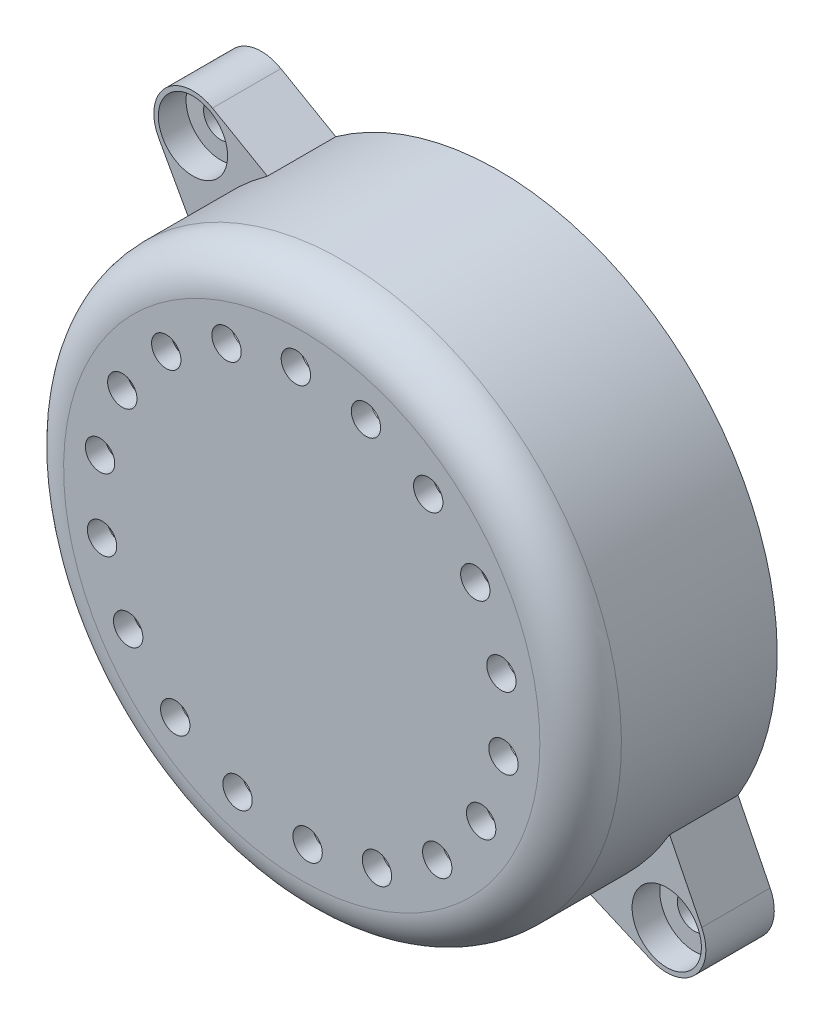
ISO-10303-21;
HEADER;
FILE_DESCRIPTION(('STEP AP214'),'2;1');
FILE_NAME('part.step','',(''),(''),'','','');
FILE_SCHEMA(('AUTOMOTIVE_DESIGN { 1 0 10303 214 1 1 1 1 }'));
ENDSEC;
DATA;
#1=APPLICATION_CONTEXT('core data for automotive mechanical design processes');
#2=APPLICATION_PROTOCOL_DEFINITION('international standard','automotive_design',2000,#1);
#3=PRODUCT_CONTEXT('',#1,'mechanical');
#4=PRODUCT('Part','Part','',(#3));
#5=PRODUCT_RELATED_PRODUCT_CATEGORY('part','',(#4));
#6=PRODUCT_DEFINITION_FORMATION('','',#4);
#7=PRODUCT_DEFINITION_CONTEXT('part definition',#1,'design');
#8=PRODUCT_DEFINITION('design','',#6,#7);
#9=PRODUCT_DEFINITION_SHAPE('','',#8);
#10=(LENGTH_UNIT() NAMED_UNIT(*) SI_UNIT(.MILLI.,.METRE.));
#11=(NAMED_UNIT(*) PLANE_ANGLE_UNIT() SI_UNIT($,.RADIAN.));
#12=(NAMED_UNIT(*) SI_UNIT($,.STERADIAN.) SOLID_ANGLE_UNIT());
#13=UNCERTAINTY_MEASURE_WITH_UNIT(LENGTH_MEASURE(1.E-05),#10,'distance_accuracy_value','');
#14=(GEOMETRIC_REPRESENTATION_CONTEXT(3) GLOBAL_UNCERTAINTY_ASSIGNED_CONTEXT((#13)) GLOBAL_UNIT_ASSIGNED_CONTEXT((#10,
#11,#12)) REPRESENTATION_CONTEXT('',''));
#15=CARTESIAN_POINT('',(0.,0.,0.));
#16=DIRECTION('',(0.,0.,1.));
#17=DIRECTION('',(1.,0.,0.));
#18=AXIS2_PLACEMENT_3D('',#15,#16,#17);
#19=CARTESIAN_POINT('',(31.5,0.,17.7));
#20=DIRECTION('',(0.,0.,1.));
#21=DIRECTION('',(1.,0.,0.));
#22=AXIS2_PLACEMENT_3D('',#19,#20,#21);
#23=PLANE('',#22);
#24=CARTESIAN_POINT('',(0.,0.,17.7));
#25=DIRECTION('',(0.,0.,1.));
#26=DIRECTION('',(1.,0.,0.));
#27=AXIS2_PLACEMENT_3D('',#24,#25,#26);
#28=CIRCLE('',#27,11.);
#29=CARTESIAN_POINT('',(11.,0.,17.7));
#30=VERTEX_POINT('',#29);
#31=EDGE_CURVE('E300',#30,#30,#28,.F.);
#32=ORIENTED_EDGE('',*,*,#31,.T.);
#33=EDGE_LOOP('',(#32));
#34=FACE_BOUND('',#33,.T.);
#35=ADVANCED_FACE('F16',(#34),#23,.F.);
#36=CARTESIAN_POINT('',(-26.9473750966,27.5,0.99));
#37=DIRECTION('',(0.,0.,-1.));
#38=DIRECTION('',(-1.,0.,0.));
#39=AXIS2_PLACEMENT_3D('',#36,#37,#38);
#40=PLANE('',#39);
#41=CARTESIAN_POINT('',(29.0473750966,-27.5,0.99));
#42=DIRECTION('',(0.,0.,-1.));
#43=DIRECTION('',(-1.,0.,0.));
#44=AXIS2_PLACEMENT_3D('',#41,#42,#43);
#45=CIRCLE('',#44,2.1);
#46=CARTESIAN_POINT('',(26.9473750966,-27.5,0.99));
#47=VERTEX_POINT('',#46);
#48=EDGE_CURVE('E294',#47,#47,#45,.T.);
#49=ORIENTED_EDGE('',*,*,#48,.T.);
#50=EDGE_LOOP('',(#49));
#51=FACE_BOUND('',#50,.T.);
#52=CARTESIAN_POINT('',(29.0473750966,-27.5,0.99));
#53=DIRECTION('',(0.,0.,-1.));
#54=DIRECTION('',(-1.,0.,0.));
#55=AXIS2_PLACEMENT_3D('',#52,#53,#54);
#56=CIRCLE('',#55,4.25);
#57=CARTESIAN_POINT('',(24.7973750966,-27.5,0.99));
#58=VERTEX_POINT('',#57);
#59=EDGE_CURVE('E297',#58,#58,#56,.F.);
#60=ORIENTED_EDGE('',*,*,#59,.T.);
#61=EDGE_LOOP('',(#60));
#62=FACE_BOUND('',#61,.T.);
#63=ADVANCED_FACE('F496',(#51,#62),#40,.F.);
#64=CARTESIAN_POINT('',(-26.9473750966,27.5,0.99));
#65=DIRECTION('',(0.,0.,-1.));
#66=DIRECTION('',(-1.,0.,0.));
#67=AXIS2_PLACEMENT_3D('',#64,#65,#66);
#68=PLANE('',#67);
#69=CARTESIAN_POINT('',(-29.0473750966,27.5,0.99));
#70=DIRECTION('',(0.,0.,-1.));
#71=DIRECTION('',(-1.,0.,0.));
#72=AXIS2_PLACEMENT_3D('',#69,#70,#71);
#73=CIRCLE('',#72,2.1);
#74=CARTESIAN_POINT('',(-31.1473750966,27.5,0.99));
#75=VERTEX_POINT('',#74);
#76=EDGE_CURVE('E291',#75,#75,#73,.T.);
#77=ORIENTED_EDGE('',*,*,#76,.T.);
#78=EDGE_LOOP('',(#77));
#79=FACE_BOUND('',#78,.T.);
#80=CARTESIAN_POINT('',(-29.0473750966,27.5,0.99));
#81=DIRECTION('',(0.,0.,-1.));
#82=DIRECTION('',(-1.,0.,0.));
#83=AXIS2_PLACEMENT_3D('',#80,#81,#82);
#84=CIRCLE('',#83,4.25);
#85=CARTESIAN_POINT('',(-33.2973750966,27.5,0.99));
#86=VERTEX_POINT('',#85);
#87=EDGE_CURVE('E288',#86,#86,#84,.F.);
#88=ORIENTED_EDGE('',*,*,#87,.T.);
#89=EDGE_LOOP('',(#88));
#90=FACE_BOUND('',#89,.T.);
#91=ADVANCED_FACE('F493',(#79,#90),#68,.F.);
#92=CARTESIAN_POINT('',(0.,0.,8.05000000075));
#93=DIRECTION('',(0.,0.,1.));
#94=DIRECTION('',(1.,0.,0.));
#95=AXIS2_PLACEMENT_3D('',#92,#93,#94);
#96=CYLINDRICAL_SURFACE('',#95,11.);
#97=ORIENTED_EDGE('',*,*,#31,.F.);
#98=EDGE_LOOP('',(#97));
#99=FACE_BOUND('',#98,.T.);
#100=CARTESIAN_POINT('',(0.,0.,9.7));
#101=DIRECTION('',(0.,0.,1.));
#102=DIRECTION('',(1.,0.,0.));
#103=AXIS2_PLACEMENT_3D('',#100,#101,#102);
#104=CIRCLE('',#103,11.);
#105=CARTESIAN_POINT('',(11.,0.,9.7));
#106=VERTEX_POINT('',#105);
#107=EDGE_CURVE('E100',#106,#106,#104,.F.);
#108=ORIENTED_EDGE('',*,*,#107,.T.);
#109=EDGE_LOOP('',(#108));
#110=FACE_BOUND('',#109,.T.);
#111=ADVANCED_FACE('F489',(#99,#110),#96,.F.);
#112=CARTESIAN_POINT('',(29.0473750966,-27.5,4.29));
#113=DIRECTION('',(0.,0.,-1.));
#114=DIRECTION('',(-1.,0.,0.));
#115=AXIS2_PLACEMENT_3D('',#112,#113,#114);
#116=CYLINDRICAL_SURFACE('',#115,4.25);
#117=ORIENTED_EDGE('',*,*,#59,.F.);
#118=EDGE_LOOP('',(#117));
#119=FACE_BOUND('',#118,.T.);
#120=CARTESIAN_POINT('',(29.0473750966,-27.5,4.39));
#121=DIRECTION('',(0.,0.,-1.));
#122=DIRECTION('',(-1.,0.,0.));
#123=AXIS2_PLACEMENT_3D('',#120,#121,#122);
#124=CIRCLE('',#123,4.25);
#125=CARTESIAN_POINT('',(24.7973750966,-27.5,4.39));
#126=VERTEX_POINT('',#125);
#127=EDGE_CURVE('E106',#126,#126,#124,.F.);
#128=ORIENTED_EDGE('',*,*,#127,.T.);
#129=EDGE_LOOP('',(#128));
#130=FACE_BOUND('',#129,.T.);
#131=ADVANCED_FACE('F486',(#119,#130),#116,.F.);
#132=CARTESIAN_POINT('',(29.0473750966,-27.5,0.195));
#133=DIRECTION('',(0.,0.,-1.));
#134=DIRECTION('',(-1.,0.,0.));
#135=AXIS2_PLACEMENT_3D('',#132,#133,#134);
#136=CYLINDRICAL_SURFACE('',#135,4.8);
#137=CARTESIAN_POINT('',(29.0473750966,-27.5,-4.));
#138=DIRECTION('',(0.,0.,-1.));
#139=DIRECTION('',(-1.,0.,0.));
#140=AXIS2_PLACEMENT_3D('',#137,#138,#139);
#141=CIRCLE('',#140,4.8);
#142=CARTESIAN_POINT('',(27.1385639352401,-31.9041389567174,-4.));
#143=VERTEX_POINT('',#142);
#144=CARTESIAN_POINT('',(33.3405352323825,-25.3531939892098,-4.));
#145=VERTEX_POINT('',#144);
#146=EDGE_CURVE('E278',#143,#145,#141,.F.);
#147=ORIENTED_EDGE('',*,*,#146,.T.);
#148=DIRECTION('',(0.,0.,1.));
#149=VECTOR('',#148,1.);
#150=CARTESIAN_POINT('',(33.3405352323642,-25.3531939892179,-4.));
#151=LINE('',#150,#149);
#152=CARTESIAN_POINT('',(33.3405352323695,-25.3531939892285,4.39));
#153=VERTEX_POINT('',#152);
#154=EDGE_CURVE('E86',#145,#153,#151,.T.);
#155=ORIENTED_EDGE('',*,*,#154,.T.);
#156=CARTESIAN_POINT('',(29.0473750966,-27.5,4.39));
#157=DIRECTION('',(0.,0.,-1.));
#158=DIRECTION('',(-1.,0.,0.));
#159=AXIS2_PLACEMENT_3D('',#156,#157,#158);
#160=CIRCLE('',#159,4.8);
#161=CARTESIAN_POINT('',(27.1385639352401,-31.9041389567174,4.39));
#162=VERTEX_POINT('',#161);
#163=EDGE_CURVE('E102',#153,#162,#160,.T.);
#164=ORIENTED_EDGE('',*,*,#163,.T.);
#165=DIRECTION('',(0.,0.,1.));
#166=VECTOR('',#165,1.);
#167=CARTESIAN_POINT('',(27.1385639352,-31.9041389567,-4.));
#168=LINE('',#167,#166);
#169=EDGE_CURVE('E91',#162,#143,#168,.F.);
#170=ORIENTED_EDGE('',*,*,#169,.T.);
#171=EDGE_LOOP('',(#147,#155,#164,#170));
#172=FACE_BOUND('',#171,.T.);
#173=ADVANCED_FACE('F103',(#172),#136,.T.);
#174=CARTESIAN_POINT('',(29.0473750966,-27.5,4.29));
#175=DIRECTION('',(0.,0.,-1.));
#176=DIRECTION('',(-1.,0.,0.));
#177=AXIS2_PLACEMENT_3D('',#174,#175,#176);
#178=CYLINDRICAL_SURFACE('',#177,2.1);
#179=ORIENTED_EDGE('',*,*,#48,.F.);
#180=EDGE_LOOP('',(#179));
#181=FACE_BOUND('',#180,.T.);
#182=CARTESIAN_POINT('',(29.0473750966,-27.5,-4.));
#183=DIRECTION('',(0.,0.,-1.));
#184=DIRECTION('',(-1.,0.,0.));
#185=AXIS2_PLACEMENT_3D('',#182,#183,#184);
#186=CIRCLE('',#185,2.1);
#187=CARTESIAN_POINT('',(26.9473750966,-27.5,-4.));
#188=VERTEX_POINT('',#187);
#189=EDGE_CURVE('E274',#188,#188,#186,.T.);
#190=ORIENTED_EDGE('',*,*,#189,.T.);
#191=EDGE_LOOP('',(#190));
#192=FACE_BOUND('',#191,.T.);
#193=ADVANCED_FACE('F479',(#181,#192),#178,.F.);
#194=CARTESIAN_POINT('',(-29.0473750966,27.5,4.29));
#195=DIRECTION('',(0.,0.,-1.));
#196=DIRECTION('',(-1.,0.,0.));
#197=AXIS2_PLACEMENT_3D('',#194,#195,#196);
#198=CYLINDRICAL_SURFACE('',#197,2.1);
#199=ORIENTED_EDGE('',*,*,#76,.F.);
#200=EDGE_LOOP('',(#199));
#201=FACE_BOUND('',#200,.T.);
#202=CARTESIAN_POINT('',(-29.0473750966,27.5,-4.));
#203=DIRECTION('',(0.,0.,-1.));
#204=DIRECTION('',(-1.,0.,0.));
#205=AXIS2_PLACEMENT_3D('',#202,#203,#204);
#206=CIRCLE('',#205,2.1);
#207=CARTESIAN_POINT('',(-31.1473750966,27.5,-4.));
#208=VERTEX_POINT('',#207);
#209=EDGE_CURVE('E271',#208,#208,#206,.T.);
#210=ORIENTED_EDGE('',*,*,#209,.T.);
#211=EDGE_LOOP('',(#210));
#212=FACE_BOUND('',#211,.T.);
#213=ADVANCED_FACE('F475',(#201,#212),#198,.F.);
#214=CARTESIAN_POINT('',(0.,0.,8.05000000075));
#215=DIRECTION('',(0.,0.,1.));
#216=DIRECTION('',(1.,0.,0.));
#217=AXIS2_PLACEMENT_3D('',#214,#215,#216);
#218=CYLINDRICAL_SURFACE('',#217,32.4);
#219=CARTESIAN_POINT('',(0.,0.,0.));
#220=DIRECTION('',(0.,0.,1.));
#221=DIRECTION('',(1.,0.,0.));
#222=AXIS2_PLACEMENT_3D('',#219,#220,#221);
#223=CIRCLE('',#222,32.4);
#224=CARTESIAN_POINT('',(32.4,0.,0.));
#225=VERTEX_POINT('',#224);
#226=EDGE_CURVE('E285',#225,#225,#223,.T.);
#227=ORIENTED_EDGE('',*,*,#226,.T.);
#228=EDGE_LOOP('',(#227));
#229=FACE_BOUND('',#228,.T.);
#230=CARTESIAN_POINT('',(0.,0.,-4.));
#231=DIRECTION('',(0.,0.,1.));
#232=DIRECTION('',(1.,0.,0.));
#233=AXIS2_PLACEMENT_3D('',#230,#231,#232);
#234=CIRCLE('',#233,32.4);
#235=CARTESIAN_POINT('',(32.4,0.,-4.));
#236=VERTEX_POINT('',#235);
#237=EDGE_CURVE('E133',#236,#236,#234,.F.);
#238=ORIENTED_EDGE('',*,*,#237,.T.);
#239=EDGE_LOOP('',(#238));
#240=FACE_BOUND('',#239,.T.);
#241=ADVANCED_FACE('F471',(#229,#240),#218,.F.);
#242=CARTESIAN_POINT('',(-29.0473750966,27.5,4.29));
#243=DIRECTION('',(0.,0.,-1.));
#244=DIRECTION('',(-1.,0.,0.));
#245=AXIS2_PLACEMENT_3D('',#242,#243,#244);
#246=CYLINDRICAL_SURFACE('',#245,4.25);
#247=ORIENTED_EDGE('',*,*,#87,.F.);
#248=EDGE_LOOP('',(#247));
#249=FACE_BOUND('',#248,.T.);
#250=CARTESIAN_POINT('',(-29.0473750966,27.5,4.39));
#251=DIRECTION('',(0.,0.,-1.));
#252=DIRECTION('',(-1.,0.,0.));
#253=AXIS2_PLACEMENT_3D('',#250,#251,#252);
#254=CIRCLE('',#253,4.25);
#255=CARTESIAN_POINT('',(-33.2973750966,27.5,4.39));
#256=VERTEX_POINT('',#255);
#257=EDGE_CURVE('E262',#256,#256,#254,.F.);
#258=ORIENTED_EDGE('',*,*,#257,.T.);
#259=EDGE_LOOP('',(#258));
#260=FACE_BOUND('',#259,.T.);
#261=ADVANCED_FACE('F467',(#249,#260),#246,.F.);
#262=CARTESIAN_POINT('',(-29.0473750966,27.5,0.195));
#263=DIRECTION('',(0.,0.,-1.));
#264=DIRECTION('',(-1.,0.,0.));
#265=AXIS2_PLACEMENT_3D('',#262,#263,#264);
#266=CYLINDRICAL_SURFACE('',#265,4.8);
#267=CARTESIAN_POINT('',(-29.0473750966,27.5,-4.));
#268=DIRECTION('',(0.,0.,-1.));
#269=DIRECTION('',(-1.,0.,0.));
#270=AXIS2_PLACEMENT_3D('',#267,#268,#269);
#271=CIRCLE('',#270,4.8);
#272=CARTESIAN_POINT('',(-26.6572512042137,31.6626082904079,-4.));
#273=VERTEX_POINT('',#272);
#274=CARTESIAN_POINT('',(-33.2464228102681,25.1744896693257,-4.));
#275=VERTEX_POINT('',#274);
#276=EDGE_CURVE('E126',#273,#275,#271,.F.);
#277=ORIENTED_EDGE('',*,*,#276,.T.);
#278=DIRECTION('',(0.,0.,1.));
#279=VECTOR('',#278,1.);
#280=CARTESIAN_POINT('',(-33.2464228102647,25.1744896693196,-4.));
#281=LINE('',#280,#279);
#282=CARTESIAN_POINT('',(-33.2464228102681,25.1744896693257,4.39));
#283=VERTEX_POINT('',#282);
#284=EDGE_CURVE('E127',#275,#283,#281,.T.);
#285=ORIENTED_EDGE('',*,*,#284,.T.);
#286=CARTESIAN_POINT('',(-29.0473750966,27.5,4.39));
#287=DIRECTION('',(0.,0.,-1.));
#288=DIRECTION('',(-1.,0.,0.));
#289=AXIS2_PLACEMENT_3D('',#286,#287,#288);
#290=CIRCLE('',#289,4.8);
#291=CARTESIAN_POINT('',(-26.6572512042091,31.6626082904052,4.39));
#292=VERTEX_POINT('',#291);
#293=EDGE_CURVE('E265',#283,#292,#290,.T.);
#294=ORIENTED_EDGE('',*,*,#293,.T.);
#295=DIRECTION('',(0.,0.,1.));
#296=VECTOR('',#295,1.);
#297=CARTESIAN_POINT('',(-26.6572512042,31.6626082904,-4.));
#298=LINE('',#297,#296);
#299=EDGE_CURVE('E130',#292,#273,#298,.F.);
#300=ORIENTED_EDGE('',*,*,#299,.T.);
#301=EDGE_LOOP('',(#277,#285,#294,#300));
#302=FACE_BOUND('',#301,.T.);
#303=ADVANCED_FACE('F463',(#302),#266,.T.);
#304=CARTESIAN_POINT('',(32.4,0.,0.));
#305=DIRECTION('',(0.,0.,1.));
#306=DIRECTION('',(1.,0.,0.));
#307=AXIS2_PLACEMENT_3D('',#304,#305,#306);
#308=PLANE('',#307);
#309=CARTESIAN_POINT('',(0.,0.,0.));
#310=DIRECTION('',(0.,0.,1.));
#311=DIRECTION('',(1.,0.,0.));
#312=AXIS2_PLACEMENT_3D('',#309,#310,#311);
#313=CIRCLE('',#312,31.5);
#314=CARTESIAN_POINT('',(31.5,0.,0.));
#315=VERTEX_POINT('',#314);
#316=EDGE_CURVE('E259',#315,#315,#313,.T.);
#317=ORIENTED_EDGE('',*,*,#316,.T.);
#318=EDGE_LOOP('',(#317));
#319=FACE_BOUND('',#318,.T.);
#320=ORIENTED_EDGE('',*,*,#226,.F.);
#321=EDGE_LOOP('',(#320));
#322=FACE_BOUND('',#321,.T.);
#323=ADVANCED_FACE('F459',(#319,#322),#308,.F.);
#324=CARTESIAN_POINT('',(14.,0.,9.7));
#325=DIRECTION('',(0.,0.,1.));
#326=DIRECTION('',(1.,0.,0.));
#327=AXIS2_PLACEMENT_3D('',#324,#325,#326);
#328=PLANE('',#327);
#329=ORIENTED_EDGE('',*,*,#107,.F.);
#330=EDGE_LOOP('',(#329));
#331=FACE_BOUND('',#330,.T.);
#332=CARTESIAN_POINT('',(0.,0.,9.7));
#333=DIRECTION('',(0.,0.,1.));
#334=DIRECTION('',(1.,0.,0.));
#335=AXIS2_PLACEMENT_3D('',#332,#333,#334);
#336=CIRCLE('',#335,14.);
#337=CARTESIAN_POINT('',(14.,0.,9.7));
#338=VERTEX_POINT('',#337);
#339=EDGE_CURVE('E119',#338,#338,#336,.T.);
#340=ORIENTED_EDGE('',*,*,#339,.F.);
#341=EDGE_LOOP('',(#340));
#342=FACE_BOUND('',#341,.T.);
#343=ADVANCED_FACE('F456',(#331,#342),#328,.F.);
#344=CARTESIAN_POINT('',(27.1385639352,-31.9041389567,-4.));
#345=DIRECTION('',(0.397668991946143,0.91752894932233,0.));
#346=DIRECTION('',(-0.91752894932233,0.397668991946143,0.));
#347=AXIS2_PLACEMENT_3D('',#344,#345,#346);
#348=PLANE('',#347);
#349=DIRECTION('',(0.,0.,1.));
#350=VECTOR('',#349,1.);
#351=CARTESIAN_POINT('',(19.0542335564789,-28.4002849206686,8.05000000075));
#352=LINE('',#351,#350);
#353=CARTESIAN_POINT('',(19.0542335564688,-28.4002849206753,-4.));
#354=VERTEX_POINT('',#353);
#355=CARTESIAN_POINT('',(19.0542335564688,-28.4002849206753,4.39));
#356=VERTEX_POINT('',#355);
#357=EDGE_CURVE('E117',#354,#356,#352,.T.);
#358=ORIENTED_EDGE('',*,*,#357,.F.);
#359=DIRECTION('',(0.917528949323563,-0.397668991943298,0.));
#360=VECTOR('',#359,1.);
#361=CARTESIAN_POINT('',(19.0542335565,-28.4002849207,-4.));
#362=LINE('',#361,#360);
#363=EDGE_CURVE('E98',#354,#143,#362,.T.);
#364=ORIENTED_EDGE('',*,*,#363,.T.);
#365=ORIENTED_EDGE('',*,*,#169,.F.);
#366=DIRECTION('',(-0.917528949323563,0.397668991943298,0.));
#367=VECTOR('',#366,1.);
#368=CARTESIAN_POINT('',(27.1385639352,-31.9041389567,4.39));
#369=LINE('',#368,#367);
#370=EDGE_CURVE('E95',#162,#356,#369,.T.);
#371=ORIENTED_EDGE('',*,*,#370,.T.);
#372=EDGE_LOOP('',(#358,#364,#365,#371));
#373=FACE_BOUND('',#372,.T.);
#374=ADVANCED_FACE('F93',(#373),#348,.F.);
#375=CARTESIAN_POINT('',(0.,0.,4.39));
#376=DIRECTION('',(0.,0.,-1.));
#377=DIRECTION('',(-1.,0.,0.));
#378=AXIS2_PLACEMENT_3D('',#375,#376,#377);
#379=PLANE('',#378);
#380=ORIENTED_EDGE('',*,*,#127,.F.);
#381=EDGE_LOOP('',(#380));
#382=FACE_BOUND('',#381,.T.);
#383=DIRECTION('',(0.447251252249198,-0.894408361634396,0.));
#384=VECTOR('',#383,1.);
#385=CARTESIAN_POINT('',(29.3998128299,-17.4725786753,4.39));
#386=LINE('',#385,#384);
#387=CARTESIAN_POINT('',(29.3998128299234,-17.4725786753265,4.39));
#388=VERTEX_POINT('',#387);
#389=EDGE_CURVE('E124',#153,#388,#386,.F.);
#390=ORIENTED_EDGE('',*,*,#389,.T.);
#391=CARTESIAN_POINT('',(0.,0.,4.39));
#392=DIRECTION('',(0.,0.,1.));
#393=DIRECTION('',(1.,0.,0.));
#394=AXIS2_PLACEMENT_3D('',#391,#392,#393);
#395=CIRCLE('',#394,34.2);
#396=EDGE_CURVE('E110',#356,#388,#395,.T.);
#397=ORIENTED_EDGE('',*,*,#396,.F.);
#398=ORIENTED_EDGE('',*,*,#370,.F.);
#399=ORIENTED_EDGE('',*,*,#163,.F.);
#400=EDGE_LOOP('',(#390,#397,#398,#399));
#401=FACE_BOUND('',#400,.T.);
#402=ADVANCED_FACE('F108',(#382,#401),#379,.F.);
#403=CARTESIAN_POINT('',(29.3998128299,-17.4725786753,-4.));
#404=DIRECTION('',(-0.894408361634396,-0.447251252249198,0.));
#405=DIRECTION('',(0.447251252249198,-0.894408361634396,0.));
#406=AXIS2_PLACEMENT_3D('',#403,#404,#405);
#407=PLANE('',#406);
#408=ORIENTED_EDGE('',*,*,#154,.F.);
#409=DIRECTION('',(-0.447251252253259,0.894408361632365,0.));
#410=VECTOR('',#409,1.);
#411=CARTESIAN_POINT('',(33.3405352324,-25.3531939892,-4.));
#412=LINE('',#411,#410);
#413=CARTESIAN_POINT('',(29.3998128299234,-17.4725786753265,-4.));
#414=VERTEX_POINT('',#413);
#415=EDGE_CURVE('E277',#145,#414,#412,.T.);
#416=ORIENTED_EDGE('',*,*,#415,.T.);
#417=DIRECTION('',(0.,0.,1.));
#418=VECTOR('',#417,1.);
#419=CARTESIAN_POINT('',(29.3998128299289,-17.4725786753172,8.05000000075));
#420=LINE('',#419,#418);
#421=EDGE_CURVE('E120',#388,#414,#420,.F.);
#422=ORIENTED_EDGE('',*,*,#421,.F.);
#423=ORIENTED_EDGE('',*,*,#389,.F.);
#424=EDGE_LOOP('',(#408,#416,#422,#423));
#425=FACE_BOUND('',#424,.T.);
#426=ADVANCED_FACE('F426',(#425),#407,.F.);
#427=CARTESIAN_POINT('',(34.2,0.,-4.));
#428=DIRECTION('',(0.,0.,1.));
#429=DIRECTION('',(1.,0.,0.));
#430=AXIS2_PLACEMENT_3D('',#427,#428,#429);
#431=PLANE('',#430);
#432=ORIENTED_EDGE('',*,*,#237,.F.);
#433=EDGE_LOOP('',(#432));
#434=FACE_BOUND('',#433,.T.);
#435=ORIENTED_EDGE('',*,*,#209,.F.);
#436=EDGE_LOOP('',(#435));
#437=FACE_BOUND('',#436,.T.);
#438=ORIENTED_EDGE('',*,*,#189,.F.);
#439=EDGE_LOOP('',(#438));
#440=FACE_BOUND('',#439,.T.);
#441=CARTESIAN_POINT('',(0.,0.,-4.));
#442=DIRECTION('',(0.,0.,1.));
#443=DIRECTION('',(1.,0.,0.));
#444=AXIS2_PLACEMENT_3D('',#441,#442,#443);
#445=CIRCLE('',#444,34.2);
#446=CARTESIAN_POINT('',(-19.9244405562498,27.7967024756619,-4.));
#447=VERTEX_POINT('',#446);
#448=EDGE_CURVE('E252',#414,#447,#445,.T.);
#449=ORIENTED_EDGE('',*,*,#448,.F.);
#450=ORIENTED_EDGE('',*,*,#415,.F.);
#451=ORIENTED_EDGE('',*,*,#146,.F.);
#452=ORIENTED_EDGE('',*,*,#363,.F.);
#453=CARTESIAN_POINT('',(0.,0.,-4.));
#454=DIRECTION('',(0.,0.,1.));
#455=DIRECTION('',(1.,0.,0.));
#456=AXIS2_PLACEMENT_3D('',#453,#454,#455);
#457=CIRCLE('',#456,34.2);
#458=CARTESIAN_POINT('',(-29.1815347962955,17.8347421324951,-4.));
#459=VERTEX_POINT('',#458);
#460=EDGE_CURVE('E123',#459,#354,#457,.T.);
#461=ORIENTED_EDGE('',*,*,#460,.F.);
#462=DIRECTION('',(-0.484481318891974,0.874801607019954,0.));
#463=VECTOR('',#462,1.);
#464=CARTESIAN_POINT('',(-29.1815347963,17.8347421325,-4.));
#465=LINE('',#464,#463);
#466=EDGE_CURVE('E115',#459,#275,#465,.T.);
#467=ORIENTED_EDGE('',*,*,#466,.T.);
#468=ORIENTED_EDGE('',*,*,#276,.F.);
#469=DIRECTION('',(0.867210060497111,-0.497942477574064,0.));
#470=VECTOR('',#469,1.);
#471=CARTESIAN_POINT('',(-26.6572512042,31.6626082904,-4.));
#472=LINE('',#471,#470);
#473=EDGE_CURVE('E132',#273,#447,#472,.T.);
#474=ORIENTED_EDGE('',*,*,#473,.T.);
#475=EDGE_LOOP('',(#449,#450,#451,#452,#461,#467,#468,#474));
#476=FACE_BOUND('',#475,.T.);
#477=ADVANCED_FACE('F433',(#434,#437,#440,#476),#431,.F.);
#478=CARTESIAN_POINT('',(-26.6572512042,31.6626082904,-4.));
#479=DIRECTION('',(-0.497942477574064,-0.867210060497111,0.));
#480=DIRECTION('',(0.867210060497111,-0.497942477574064,0.));
#481=AXIS2_PLACEMENT_3D('',#478,#479,#480);
#482=PLANE('',#481);
#483=DIRECTION('',(0.,0.,1.));
#484=VECTOR('',#483,1.);
#485=CARTESIAN_POINT('',(-19.9244405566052,27.7967024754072,8.05000000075));
#486=LINE('',#485,#484);
#487=CARTESIAN_POINT('',(-19.9244405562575,27.7967024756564,4.39));
#488=VERTEX_POINT('',#487);
#489=EDGE_CURVE('E251',#447,#488,#486,.T.);
#490=ORIENTED_EDGE('',*,*,#489,.F.);
#491=ORIENTED_EDGE('',*,*,#473,.F.);
#492=ORIENTED_EDGE('',*,*,#299,.F.);
#493=DIRECTION('',(0.867210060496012,-0.497942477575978,0.));
#494=VECTOR('',#493,1.);
#495=CARTESIAN_POINT('',(-26.6572512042,31.6626082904,4.39));
#496=LINE('',#495,#494);
#497=EDGE_CURVE('E268',#292,#488,#496,.T.);
#498=ORIENTED_EDGE('',*,*,#497,.T.);
#499=EDGE_LOOP('',(#490,#491,#492,#498));
#500=FACE_BOUND('',#499,.T.);
#501=ADVANCED_FACE('F435',(#500),#482,.F.);
#502=CARTESIAN_POINT('',(0.,0.,4.39));
#503=DIRECTION('',(0.,0.,-1.));
#504=DIRECTION('',(-1.,0.,0.));
#505=AXIS2_PLACEMENT_3D('',#502,#503,#504);
#506=PLANE('',#505);
#507=ORIENTED_EDGE('',*,*,#257,.F.);
#508=EDGE_LOOP('',(#507));
#509=FACE_BOUND('',#508,.T.);
#510=DIRECTION('',(-0.484481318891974,0.874801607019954,0.));
#511=VECTOR('',#510,1.);
#512=CARTESIAN_POINT('',(-29.1815347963,17.8347421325,4.39));
#513=LINE('',#512,#511);
#514=CARTESIAN_POINT('',(-29.1815347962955,17.8347421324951,4.39));
#515=VERTEX_POINT('',#514);
#516=EDGE_CURVE('E129',#283,#515,#513,.F.);
#517=ORIENTED_EDGE('',*,*,#516,.T.);
#518=CARTESIAN_POINT('',(0.,0.,4.39));
#519=DIRECTION('',(0.,0.,1.));
#520=DIRECTION('',(1.,0.,0.));
#521=AXIS2_PLACEMENT_3D('',#518,#519,#520);
#522=CIRCLE('',#521,34.2);
#523=EDGE_CURVE('E248',#488,#515,#522,.T.);
#524=ORIENTED_EDGE('',*,*,#523,.F.);
#525=ORIENTED_EDGE('',*,*,#497,.F.);
#526=ORIENTED_EDGE('',*,*,#293,.F.);
#527=EDGE_LOOP('',(#517,#524,#525,#526));
#528=FACE_BOUND('',#527,.T.);
#529=ADVANCED_FACE('F443',(#509,#528),#506,.F.);
#530=CARTESIAN_POINT('',(-29.1815347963,17.8347421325,-4.));
#531=DIRECTION('',(0.874801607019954,0.484481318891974,0.));
#532=DIRECTION('',(-0.484481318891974,0.874801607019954,0.));
#533=AXIS2_PLACEMENT_3D('',#530,#531,#532);
#534=PLANE('',#533);
#535=ORIENTED_EDGE('',*,*,#284,.F.);
#536=ORIENTED_EDGE('',*,*,#466,.F.);
#537=DIRECTION('',(0.,0.,1.));
#538=VECTOR('',#537,1.);
#539=CARTESIAN_POINT('',(-29.1815347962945,17.8347421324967,8.05000000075));
#540=LINE('',#539,#538);
#541=EDGE_CURVE('E247',#515,#459,#540,.F.);
#542=ORIENTED_EDGE('',*,*,#541,.F.);
#543=ORIENTED_EDGE('',*,*,#516,.F.);
#544=EDGE_LOOP('',(#535,#536,#542,#543));
#545=FACE_BOUND('',#544,.T.);
#546=ADVANCED_FACE('F537',(#545),#534,.F.);
#547=CARTESIAN_POINT('',(0.,0.,8.05000000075));
#548=DIRECTION('',(0.,0.,1.));
#549=DIRECTION('',(1.,0.,0.));
#550=AXIS2_PLACEMENT_3D('',#547,#548,#549);
#551=CYLINDRICAL_SURFACE('',#550,31.5);
#552=CARTESIAN_POINT('',(0.,0.,17.7));
#553=DIRECTION('',(0.,0.,1.));
#554=DIRECTION('',(1.,0.,0.));
#555=AXIS2_PLACEMENT_3D('',#552,#553,#554);
#556=CIRCLE('',#555,31.5);
#557=CARTESIAN_POINT('',(31.5,0.,17.7));
#558=VERTEX_POINT('',#557);
#559=EDGE_CURVE('E244',#558,#558,#556,.T.);
#560=ORIENTED_EDGE('',*,*,#559,.T.);
#561=EDGE_LOOP('',(#560));
#562=FACE_BOUND('',#561,.T.);
#563=ORIENTED_EDGE('',*,*,#316,.F.);
#564=EDGE_LOOP('',(#563));
#565=FACE_BOUND('',#564,.T.);
#566=ADVANCED_FACE('F524',(#562,#565),#551,.F.);
#567=CARTESIAN_POINT('',(0.,0.,8.05000000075));
#568=DIRECTION('',(0.,0.,1.));
#569=DIRECTION('',(1.,0.,0.));
#570=AXIS2_PLACEMENT_3D('',#567,#568,#569);
#571=CYLINDRICAL_SURFACE('',#570,14.);
#572=ORIENTED_EDGE('',*,*,#339,.T.);
#573=EDGE_LOOP('',(#572));
#574=FACE_BOUND('',#573,.T.);
#575=CARTESIAN_POINT('',(0.,0.,17.7));
#576=DIRECTION('',(0.,0.,1.));
#577=DIRECTION('',(1.,0.,0.));
#578=AXIS2_PLACEMENT_3D('',#575,#576,#577);
#579=CIRCLE('',#578,14.);
#580=CARTESIAN_POINT('',(14.,0.,17.7));
#581=VERTEX_POINT('',#580);
#582=EDGE_CURVE('E241',#581,#581,#579,.F.);
#583=ORIENTED_EDGE('',*,*,#582,.T.);
#584=EDGE_LOOP('',(#583));
#585=FACE_BOUND('',#584,.T.);
#586=ADVANCED_FACE('F521',(#574,#585),#571,.T.);
#587=CARTESIAN_POINT('',(0.,0.,8.05000000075));
#588=DIRECTION('',(0.,0.,1.));
#589=DIRECTION('',(1.,0.,0.));
#590=AXIS2_PLACEMENT_3D('',#587,#588,#589);
#591=CYLINDRICAL_SURFACE('',#590,34.2);
#592=CARTESIAN_POINT('',(0.,0.,15.1));
#593=DIRECTION('',(0.,0.,1.));
#594=DIRECTION('',(0.877582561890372,0.479425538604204,0.));
#595=AXIS2_PLACEMENT_3D('',#592,#593,#594);
#596=CIRCLE('',#595,34.2);
#597=CARTESIAN_POINT('',(30.0133236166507,16.3963534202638,15.1));
#598=VERTEX_POINT('',#597);
#599=EDGE_CURVE('E240',#598,#598,#596,.T.);
#600=ORIENTED_EDGE('',*,*,#599,.F.);
#601=EDGE_LOOP('',(#600));
#602=FACE_BOUND('',#601,.T.);
#603=ORIENTED_EDGE('',*,*,#523,.T.);
#604=ORIENTED_EDGE('',*,*,#541,.T.);
#605=ORIENTED_EDGE('',*,*,#460,.T.);
#606=ORIENTED_EDGE('',*,*,#357,.T.);
#607=ORIENTED_EDGE('',*,*,#396,.T.);
#608=ORIENTED_EDGE('',*,*,#421,.T.);
#609=ORIENTED_EDGE('',*,*,#448,.T.);
#610=ORIENTED_EDGE('',*,*,#489,.T.);
#611=EDGE_LOOP('',(#603,#604,#605,#606,#607,#608,#609,#610));
#612=FACE_BOUND('',#611,.T.);
#613=ADVANCED_FACE('F429',(#602,#612),#591,.T.);
#614=CARTESIAN_POINT('',(31.5,0.,17.7));
#615=DIRECTION('',(0.,0.,1.));
#616=DIRECTION('',(1.,0.,0.));
#617=AXIS2_PLACEMENT_3D('',#614,#615,#616);
#618=PLANE('',#617);
#619=CARTESIAN_POINT('',(7.87019810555,23.728884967,17.7));
#620=DIRECTION('',(0.,0.,1.));
#621=DIRECTION('',(1.,0.,0.));
#622=AXIS2_PLACEMENT_3D('',#619,#620,#621);
#623=CIRCLE('',#622,1.8);
#624=CARTESIAN_POINT('',(9.67019810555,23.728884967,17.7));
#625=VERTEX_POINT('',#624);
#626=EDGE_CURVE('E185',#625,#625,#623,.T.);
#627=ORIENTED_EDGE('',*,*,#626,.T.);
#628=EDGE_LOOP('',(#627));
#629=FACE_BOUND('',#628,.T.);
#630=CARTESIAN_POINT('',(15.5113237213,19.606091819,17.7));
#631=DIRECTION('',(0.,0.,1.));
#632=DIRECTION('',(1.,0.,0.));
#633=AXIS2_PLACEMENT_3D('',#630,#631,#632);
#634=CIRCLE('',#633,1.8);
#635=CARTESIAN_POINT('',(17.3113237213,19.606091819,17.7));
#636=VERTEX_POINT('',#635);
#637=EDGE_CURVE('E189',#636,#636,#634,.T.);
#638=ORIENTED_EDGE('',*,*,#637,.T.);
#639=EDGE_LOOP('',(#638));
#640=FACE_BOUND('',#639,.T.);
#641=CARTESIAN_POINT('',(21.2815547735,13.1185146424,17.7));
#642=DIRECTION('',(0.,0.,1.));
#643=DIRECTION('',(1.,0.,0.));
#644=AXIS2_PLACEMENT_3D('',#641,#642,#643);
#645=CIRCLE('',#644,1.8);
#646=CARTESIAN_POINT('',(23.0815547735,13.1185146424,17.7));
#647=VERTEX_POINT('',#646);
#648=EDGE_CURVE('E192',#647,#647,#645,.T.);
#649=ORIENTED_EDGE('',*,*,#648,.T.);
#650=EDGE_LOOP('',(#649));
#651=FACE_BOUND('',#650,.T.);
#652=CARTESIAN_POINT('',(24.4849162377,5.0486509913,17.7));
#653=DIRECTION('',(0.,0.,1.));
#654=DIRECTION('',(1.,0.,0.));
#655=AXIS2_PLACEMENT_3D('',#652,#653,#654);
#656=CIRCLE('',#655,1.8);
#657=CARTESIAN_POINT('',(26.2849162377,5.0486509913,17.7));
#658=VERTEX_POINT('',#657);
#659=EDGE_CURVE('E195',#658,#658,#656,.T.);
#660=ORIENTED_EDGE('',*,*,#659,.T.);
#661=EDGE_LOOP('',(#660));
#662=FACE_BOUND('',#661,.T.);
#663=CARTESIAN_POINT('',(24.7350354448,-3.63015447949,17.7));
#664=DIRECTION('',(0.,0.,1.));
#665=DIRECTION('',(1.,0.,0.));
#666=AXIS2_PLACEMENT_3D('',#663,#664,#665);
#667=CIRCLE('',#666,1.8);
#668=CARTESIAN_POINT('',(26.5350354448,-3.63015447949,17.7));
#669=VERTEX_POINT('',#668);
#670=EDGE_CURVE('E198',#669,#669,#667,.T.);
#671=ORIENTED_EDGE('',*,*,#670,.T.);
#672=EDGE_LOOP('',(#671));
#673=FACE_BOUND('',#672,.T.);
#674=CARTESIAN_POINT('',(22.001744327,-11.8711097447,17.7));
#675=DIRECTION('',(0.,0.,1.));
#676=DIRECTION('',(1.,0.,0.));
#677=AXIS2_PLACEMENT_3D('',#674,#675,#676);
#678=CIRCLE('',#677,1.8);
#679=CARTESIAN_POINT('',(23.801744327,-11.8711097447,17.7));
#680=VERTEX_POINT('',#679);
#681=EDGE_CURVE('E201',#680,#680,#678,.T.);
#682=ORIENTED_EDGE('',*,*,#681,.T.);
#683=EDGE_LOOP('',(#682));
#684=FACE_BOUND('',#683,.T.);
#685=CARTESIAN_POINT('',(16.6147181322,-18.6802339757,17.7));
#686=DIRECTION('',(0.,0.,1.));
#687=DIRECTION('',(1.,0.,0.));
#688=AXIS2_PLACEMENT_3D('',#685,#686,#687);
#689=CIRCLE('',#688,1.8);
#690=CARTESIAN_POINT('',(18.4147181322,-18.6802339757,17.7));
#691=VERTEX_POINT('',#690);
#692=EDGE_CURVE('E204',#691,#691,#689,.T.);
#693=ORIENTED_EDGE('',*,*,#692,.T.);
#694=EDGE_LOOP('',(#693));
#695=FACE_BOUND('',#694,.T.);
#696=CARTESIAN_POINT('',(9.22371172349,-23.2362462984,17.7));
#697=DIRECTION('',(0.,0.,1.));
#698=DIRECTION('',(1.,0.,0.));
#699=AXIS2_PLACEMENT_3D('',#696,#697,#698);
#700=CIRCLE('',#699,1.8);
#701=CARTESIAN_POINT('',(11.02371172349,-23.2362462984,17.7));
#702=VERTEX_POINT('',#701);
#703=EDGE_CURVE('E207',#702,#702,#700,.T.);
#704=ORIENTED_EDGE('',*,*,#703,.T.);
#705=EDGE_LOOP('',(#704));
#706=FACE_BOUND('',#705,.T.);
#707=CARTESIAN_POINT('',(0.72018955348,-24.9896243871,17.7));
#708=DIRECTION('',(0.,0.,1.));
#709=DIRECTION('',(1.,0.,0.));
#710=AXIS2_PLACEMENT_3D('',#707,#708,#709);
#711=CIRCLE('',#710,1.8);
#712=CARTESIAN_POINT('',(2.52018955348,-24.9896243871,17.7));
#713=VERTEX_POINT('',#712);
#714=EDGE_CURVE('E210',#713,#713,#711,.T.);
#715=ORIENTED_EDGE('',*,*,#714,.T.);
#716=EDGE_LOOP('',(#715));
#717=FACE_BOUND('',#716,.T.);
#718=CARTESIAN_POINT('',(-7.87019810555,-23.728884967,17.7));
#719=DIRECTION('',(0.,0.,1.));
#720=DIRECTION('',(1.,0.,0.));
#721=AXIS2_PLACEMENT_3D('',#718,#719,#720);
#722=CIRCLE('',#721,1.8);
#723=CARTESIAN_POINT('',(-6.07019810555,-23.728884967,17.7));
#724=VERTEX_POINT('',#723);
#725=EDGE_CURVE('E213',#724,#724,#722,.T.);
#726=ORIENTED_EDGE('',*,*,#725,.T.);
#727=EDGE_LOOP('',(#726));
#728=FACE_BOUND('',#727,.T.);
#729=CARTESIAN_POINT('',(-15.5113237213,-19.606091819,17.7));
#730=DIRECTION('',(0.,0.,1.));
#731=DIRECTION('',(1.,0.,0.));
#732=AXIS2_PLACEMENT_3D('',#729,#730,#731);
#733=CIRCLE('',#732,1.8);
#734=CARTESIAN_POINT('',(-13.7113237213,-19.606091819,17.7));
#735=VERTEX_POINT('',#734);
#736=EDGE_CURVE('E216',#735,#735,#733,.T.);
#737=ORIENTED_EDGE('',*,*,#736,.T.);
#738=EDGE_LOOP('',(#737));
#739=FACE_BOUND('',#738,.T.);
#740=CARTESIAN_POINT('',(-21.2815547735,-13.1185146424,17.7));
#741=DIRECTION('',(0.,0.,1.));
#742=DIRECTION('',(1.,0.,0.));
#743=AXIS2_PLACEMENT_3D('',#740,#741,#742);
#744=CIRCLE('',#743,1.8);
#745=CARTESIAN_POINT('',(-19.4815547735,-13.1185146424,17.7));
#746=VERTEX_POINT('',#745);
#747=EDGE_CURVE('E219',#746,#746,#744,.T.);
#748=ORIENTED_EDGE('',*,*,#747,.T.);
#749=EDGE_LOOP('',(#748));
#750=FACE_BOUND('',#749,.T.);
#751=CARTESIAN_POINT('',(-24.4849162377,-5.0486509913,17.7));
#752=DIRECTION('',(0.,0.,1.));
#753=DIRECTION('',(1.,0.,0.));
#754=AXIS2_PLACEMENT_3D('',#751,#752,#753);
#755=CIRCLE('',#754,1.8);
#756=CARTESIAN_POINT('',(-22.6849162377,-5.0486509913,17.7));
#757=VERTEX_POINT('',#756);
#758=EDGE_CURVE('E222',#757,#757,#755,.T.);
#759=ORIENTED_EDGE('',*,*,#758,.T.);
#760=EDGE_LOOP('',(#759));
#761=FACE_BOUND('',#760,.T.);
#762=CARTESIAN_POINT('',(-24.7350354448,3.63015447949,17.7));
#763=DIRECTION('',(0.,0.,1.));
#764=DIRECTION('',(1.,0.,0.));
#765=AXIS2_PLACEMENT_3D('',#762,#763,#764);
#766=CIRCLE('',#765,1.8);
#767=CARTESIAN_POINT('',(-22.9350354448,3.63015447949,17.7));
#768=VERTEX_POINT('',#767);
#769=EDGE_CURVE('E225',#768,#768,#766,.T.);
#770=ORIENTED_EDGE('',*,*,#769,.T.);
#771=EDGE_LOOP('',(#770));
#772=FACE_BOUND('',#771,.T.);
#773=CARTESIAN_POINT('',(-22.001744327,11.8711097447,17.7));
#774=DIRECTION('',(0.,0.,1.));
#775=DIRECTION('',(1.,0.,0.));
#776=AXIS2_PLACEMENT_3D('',#773,#774,#775);
#777=CIRCLE('',#776,1.8);
#778=CARTESIAN_POINT('',(-20.201744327,11.8711097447,17.7));
#779=VERTEX_POINT('',#778);
#780=EDGE_CURVE('E228',#779,#779,#777,.T.);
#781=ORIENTED_EDGE('',*,*,#780,.T.);
#782=EDGE_LOOP('',(#781));
#783=FACE_BOUND('',#782,.T.);
#784=CARTESIAN_POINT('',(-16.6147181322,18.6802339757,17.7));
#785=DIRECTION('',(0.,0.,1.));
#786=DIRECTION('',(1.,0.,0.));
#787=AXIS2_PLACEMENT_3D('',#784,#785,#786);
#788=CIRCLE('',#787,1.8);
#789=CARTESIAN_POINT('',(-14.8147181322,18.6802339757,17.7));
#790=VERTEX_POINT('',#789);
#791=EDGE_CURVE('E231',#790,#790,#788,.T.);
#792=ORIENTED_EDGE('',*,*,#791,.T.);
#793=EDGE_LOOP('',(#792));
#794=FACE_BOUND('',#793,.T.);
#795=CARTESIAN_POINT('',(-9.22371172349,23.2362462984,17.7));
#796=DIRECTION('',(0.,0.,1.));
#797=DIRECTION('',(1.,0.,0.));
#798=AXIS2_PLACEMENT_3D('',#795,#796,#797);
#799=CIRCLE('',#798,1.8);
#800=CARTESIAN_POINT('',(-7.42371172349,23.2362462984,17.7));
#801=VERTEX_POINT('',#800);
#802=EDGE_CURVE('E234',#801,#801,#799,.T.);
#803=ORIENTED_EDGE('',*,*,#802,.T.);
#804=EDGE_LOOP('',(#803));
#805=FACE_BOUND('',#804,.T.);
#806=ORIENTED_EDGE('',*,*,#582,.F.);
#807=EDGE_LOOP('',(#806));
#808=FACE_BOUND('',#807,.T.);
#809=CARTESIAN_POINT('',(-0.72018955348,24.9896243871,17.7));
#810=DIRECTION('',(0.,0.,1.));
#811=DIRECTION('',(1.,0.,0.));
#812=AXIS2_PLACEMENT_3D('',#809,#810,#811);
#813=CIRCLE('',#812,1.8);
#814=CARTESIAN_POINT('',(1.07981044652,24.9896243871,17.7));
#815=VERTEX_POINT('',#814);
#816=EDGE_CURVE('E237',#815,#815,#813,.T.);
#817=ORIENTED_EDGE('',*,*,#816,.T.);
#818=EDGE_LOOP('',(#817));
#819=FACE_BOUND('',#818,.T.);
#820=ORIENTED_EDGE('',*,*,#559,.F.);
#821=EDGE_LOOP('',(#820));
#822=FACE_BOUND('',#821,.T.);
#823=ADVANCED_FACE('F400',(#629,#640,#651,#662,#673,#684,#695,#706,#717,#728,#739,#750,#761,
#772,#783,#794,#805,#808,#819,#822),#618,.F.);
#824=CARTESIAN_POINT('',(0.,0.,15.1));
#825=DIRECTION('',(0.,0.,1.));
#826=DIRECTION('',(0.877582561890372,0.479425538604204,0.));
#827=AXIS2_PLACEMENT_3D('',#824,#825,#826);
#828=TOROIDAL_SURFACE('',#827,29.2,5.);
#829=ORIENTED_EDGE('',*,*,#599,.T.);
#830=EDGE_LOOP('',(#829));
#831=FACE_BOUND('',#830,.T.);
#832=CARTESIAN_POINT('',(0.,0.,20.1));
#833=DIRECTION('',(0.,0.,-1.));
#834=DIRECTION('',(-0.877582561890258,-0.479425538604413,0.));
#835=AXIS2_PLACEMENT_3D('',#832,#833,#834);
#836=CIRCLE('',#835,29.2000000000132);
#837=CARTESIAN_POINT('',(25.6254108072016,13.9992257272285,20.1));
#838=VERTEX_POINT('',#837);
#839=CARTESIAN_POINT('',(-25.6254108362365,-13.9992256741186,20.1));
#840=VERTEX_POINT('',#839);
#841=EDGE_CURVE('E35',#838,#840,#836,.F.);
#842=ORIENTED_EDGE('',*,*,#841,.F.);
#843=CARTESIAN_POINT('',(25.6254108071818,13.9992257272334,20.1));
#844=CARTESIAN_POINT('',(25.7049477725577,13.8536345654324,20.0999999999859));
#845=CARTESIAN_POINT('',(25.7832467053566,13.7073670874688,20.0999999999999));
#846=CARTESIAN_POINT('',(25.9373464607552,13.4135219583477,20.0999999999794));
#847=CARTESIAN_POINT('',(26.013147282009,13.2659443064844,20.0999999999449));
#848=CARTESIAN_POINT('',(26.162228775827,12.9695212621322,20.0999999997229));
#849=CARTESIAN_POINT('',(26.2355094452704,12.8206758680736,20.0999999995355));
#850=CARTESIAN_POINT('',(26.3795296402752,12.5217605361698,20.0999999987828));
#851=CARTESIAN_POINT('',(26.450269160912,12.3716905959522,20.0999999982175));
#852=CARTESIAN_POINT('',(26.5891862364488,12.070368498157,20.0999999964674));
#853=CARTESIAN_POINT('',(26.6573637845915,11.9191163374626,20.0999999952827));
#854=CARTESIAN_POINT('',(26.7660561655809,11.6724088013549,20.099999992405));
#855=CARTESIAN_POINT('',(26.8073571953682,11.5772991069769,20.0999999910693));
#856=CARTESIAN_POINT('',(26.8726229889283,11.4247811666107,20.09999998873));
#857=CARTESIAN_POINT('',(26.8969132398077,11.3675119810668,20.0999999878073));
#858=CARTESIAN_POINT('',(26.9852999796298,11.1572405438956,20.0999999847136));
#859=CARTESIAN_POINT('',(27.048268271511,11.0037619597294,20.0999999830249));
#860=CARTESIAN_POINT('',(27.1715611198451,10.6957478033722,20.099999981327));
#861=CARTESIAN_POINT('',(27.2318856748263,10.5412122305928,20.0999999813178));
#862=CARTESIAN_POINT('',(27.3498739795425,10.2311284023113,20.0999999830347));
#863=CARTESIAN_POINT('',(27.4075377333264,10.0755801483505,20.0999999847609));
#864=CARTESIAN_POINT('',(27.5201835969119,9.76351688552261,20.0999999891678));
#865=CARTESIAN_POINT('',(27.5751657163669,9.60700188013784,20.0999999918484));
#866=CARTESIAN_POINT('',(27.6824461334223,9.29305404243,20.0999999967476));
#867=CARTESIAN_POINT('',(27.7347444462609,9.13562121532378,20.0999999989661));
#868=CARTESIAN_POINT('',(27.7983976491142,8.9382786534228,20.0999999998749));
#869=CARTESIAN_POINT('',(27.8110423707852,8.898782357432,20.0999999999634));
#870=CARTESIAN_POINT('',(27.8389019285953,8.81120023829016,20.1000000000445));
#871=CARTESIAN_POINT('',(27.8540814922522,8.76310317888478,20.1000000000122));
#872=CARTESIAN_POINT('',(27.9156463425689,8.56627277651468,20.0999999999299));
#873=CARTESIAN_POINT('',(27.9609758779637,8.41720851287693,20.0999999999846));
#874=CARTESIAN_POINT('',(28.0834206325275,8.00268937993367,20.0999999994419));
#875=CARTESIAN_POINT('',(28.1579744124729,7.73647201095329,20.0999999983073));
#876=CARTESIAN_POINT('',(28.2749331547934,7.29476313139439,20.0999999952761));
#877=CARTESIAN_POINT('',(28.3195169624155,7.11984398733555,20.0999999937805));
#878=CARTESIAN_POINT('',(28.4030343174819,6.77895720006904,20.0999999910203));
#879=CARTESIAN_POINT('',(28.4421442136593,6.61303287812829,20.0999999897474));
#880=CARTESIAN_POINT('',(28.5086043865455,6.31953684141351,20.0999999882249));
#881=CARTESIAN_POINT('',(28.5365606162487,6.19210174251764,20.0999999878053));
#882=CARTESIAN_POINT('',(28.6036998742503,5.87590374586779,20.0999999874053));
#883=CARTESIAN_POINT('',(28.6418666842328,5.68692382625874,20.0999999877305));
#884=CARTESIAN_POINT('',(28.7104092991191,5.32928327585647,20.0999999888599));
#885=CARTESIAN_POINT('',(28.7411795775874,5.16069798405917,20.0999999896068));
#886=CARTESIAN_POINT('',(28.7997397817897,4.82301024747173,20.0999999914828));
#887=CARTESIAN_POINT('',(28.8275297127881,4.65390780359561,20.0999999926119));
#888=CARTESIAN_POINT('',(28.8801186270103,4.31523938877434,20.0999999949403));
#889=CARTESIAN_POINT('',(28.9049176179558,4.14567341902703,20.0999999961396));
#890=CARTESIAN_POINT('',(28.9515251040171,3.80613045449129,20.0999999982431));
#891=CARTESIAN_POINT('',(28.9733336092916,3.63615346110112,20.0999999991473));
#892=CARTESIAN_POINT('',(29.0037754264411,3.38091924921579,20.0999999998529));
#893=CARTESIAN_POINT('',(29.0135442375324,3.29579610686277,20.0999999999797));
#894=CARTESIAN_POINT('',(29.0266485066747,3.17719081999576,20.100000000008));
#895=CARTESIAN_POINT('',(29.0302880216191,3.1437421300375,20.0999999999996));
#896=CARTESIAN_POINT('',(29.0484030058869,2.97460975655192,20.0999999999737));
#897=CARTESIAN_POINT('',(29.0620083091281,2.83883226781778,20.100000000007));
#898=CARTESIAN_POINT('',(29.09586497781,2.47527887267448,20.0999999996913));
#899=CARTESIAN_POINT('',(29.1143943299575,2.24733924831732,20.0999999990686));
#900=CARTESIAN_POINT('',(29.1365149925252,1.92906586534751,20.099999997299));
#901=CARTESIAN_POINT('',(29.1423631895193,1.83888301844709,20.0999999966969));
#902=CARTESIAN_POINT('',(29.155960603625,1.61294588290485,20.0999999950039));
#903=CARTESIAN_POINT('',(29.1631799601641,1.47715916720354,20.0999999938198));
#904=CARTESIAN_POINT('',(29.1776747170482,1.16304752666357,20.0999999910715));
#905=CARTESIAN_POINT('',(29.1842625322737,0.984690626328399,20.0999999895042));
#906=CARTESIAN_POINT('',(29.1940131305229,0.632932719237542,20.0999999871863));
#907=CARTESIAN_POINT('',(29.1972675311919,0.459534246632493,20.0999999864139));
#908=CARTESIAN_POINT('',(29.2004615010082,0.134174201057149,20.0999999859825));
#909=CARTESIAN_POINT('',(29.2007615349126,-0.0177839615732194,20.0999999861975));
#910=CARTESIAN_POINT('',(29.1988570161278,-0.343393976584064,20.0999999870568));
#911=CARTESIAN_POINT('',(29.1962885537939,-0.517043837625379,20.0999999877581));
#912=CARTESIAN_POINT('',(29.188045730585,-0.864269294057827,20.0999999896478));
#913=CARTESIAN_POINT('',(29.1823713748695,-1.03784488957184,20.0999999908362));
#914=CARTESIAN_POINT('',(29.1679166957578,-1.38486613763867,20.0999999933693));
#915=CARTESIAN_POINT('',(29.159136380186,-1.55831179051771,20.0999999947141));
#916=CARTESIAN_POINT('',(29.1384815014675,-1.90501881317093,20.099999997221));
#917=CARTESIAN_POINT('',(29.1266069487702,-2.07828018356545,20.0999999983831));
#918=CARTESIAN_POINT('',(29.1030928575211,-2.38127397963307,20.0999999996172));
#919=CARTESIAN_POINT('',(29.0921367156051,-2.51105987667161,20.0999999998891));
#920=CARTESIAN_POINT('',(29.0689745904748,-2.76579686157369,20.1000000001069));
#921=CARTESIAN_POINT('',(29.0568279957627,-2.89075336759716,20.1000000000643));
#922=CARTESIAN_POINT('',(29.0227763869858,-3.21911414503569,20.0999999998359));
#923=CARTESIAN_POINT('',(28.9995419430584,-3.42238244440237,20.0999999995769));
#924=CARTESIAN_POINT('',(28.9548660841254,-3.77993959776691,20.0999999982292));
#925=CARTESIAN_POINT('',(28.9343199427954,-3.9343410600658,20.0999999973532));
#926=CARTESIAN_POINT('',(28.9003431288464,-4.17492928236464,20.0999999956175));
#927=CARTESIAN_POINT('',(28.8877596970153,-4.26123645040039,20.0999999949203));
#928=CARTESIAN_POINT('',(28.8475753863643,-4.52843786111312,20.0999999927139));
#929=CARTESIAN_POINT('',(28.8186560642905,-4.70913585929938,20.0999999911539));
#930=CARTESIAN_POINT('',(28.761225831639,-5.04749917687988,20.0999999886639));
#931=CARTESIAN_POINT('',(28.7331120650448,-5.20523205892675,20.0999999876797));
#932=CARTESIAN_POINT('',(28.6937417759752,-5.41600622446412,20.0999999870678));
#933=CARTESIAN_POINT('',(28.6836392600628,-5.46926461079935,20.0999999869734));
#934=CARTESIAN_POINT('',(28.6529987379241,-5.62836467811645,20.0999999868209));
#935=CARTESIAN_POINT('',(28.63202081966,-5.73412193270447,20.099999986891));
#936=CARTESIAN_POINT('',(28.5759533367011,-6.00877922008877,20.0999999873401));
#937=CARTESIAN_POINT('',(28.539948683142,-6.17749318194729,20.0999999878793));
#938=CARTESIAN_POINT('',(28.4649475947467,-6.51425391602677,20.0999999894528));
#939=CARTESIAN_POINT('',(28.4259511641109,-6.6823006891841,20.0999999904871));
#940=CARTESIAN_POINT('',(28.3449766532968,-7.01767409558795,20.0999999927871));
#941=CARTESIAN_POINT('',(28.3029985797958,-7.18500073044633,20.0999999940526));
#942=CARTESIAN_POINT('',(28.2160827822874,-7.51888285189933,20.0999999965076));
#943=CARTESIAN_POINT('',(28.171145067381,-7.68543834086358,20.099999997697));
#944=CARTESIAN_POINT('',(28.0782916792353,-8.0177173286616,20.0999999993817));
#945=CARTESIAN_POINT('',(28.0303760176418,-8.18344083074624,20.0999999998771));
#946=CARTESIAN_POINT('',(27.9564591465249,-8.43109227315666,20.1000000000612));
#947=CARTESIAN_POINT('',(27.9315260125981,-8.51334091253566,20.10000000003));
#948=CARTESIAN_POINT('',(27.8542075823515,-8.76443141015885,20.0999999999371));
#949=CARTESIAN_POINT('',(27.8006598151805,-8.93291718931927,20.0999999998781));
#950=CARTESIAN_POINT('',(27.6800054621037,-9.30095005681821,20.0999999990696));
#951=CARTESIAN_POINT('',(27.6122615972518,-9.50028825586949,20.0999999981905));
#952=CARTESIAN_POINT('',(27.4690280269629,-9.90725029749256,20.0999999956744));
#953=CARTESIAN_POINT('',(27.3933210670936,-10.1147977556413,20.0999999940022));
#954=CARTESIAN_POINT('',(27.2581720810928,-10.4725955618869,20.0999999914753));
#955=CARTESIAN_POINT('',(27.1998242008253,-10.6232600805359,20.0999999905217));
#956=CARTESIAN_POINT('',(27.107164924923,-10.8567236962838,20.0999999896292));
#957=CARTESIAN_POINT('',(27.0737201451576,-10.9398673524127,20.0999999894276));
#958=CARTESIAN_POINT('',(27.0161061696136,-11.0812040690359,20.0999999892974));
#959=CARTESIAN_POINT('',(26.9921310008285,-11.1394763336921,20.0999999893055));
#960=CARTESIAN_POINT('',(26.9035300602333,-11.352853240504,20.0999999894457));
#961=CARTESIAN_POINT('',(26.8377498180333,-11.5074806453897,20.099999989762));
#962=CARTESIAN_POINT('',(26.7035235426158,-11.8155724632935,20.0999999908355));
#963=CARTESIAN_POINT('',(26.6350775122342,-11.9690368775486,20.0999999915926));
#964=CARTESIAN_POINT('',(26.4955395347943,-12.2747583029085,20.0999999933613));
#965=CARTESIAN_POINT('',(26.4244475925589,-12.4270153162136,20.0999999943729));
#966=CARTESIAN_POINT('',(26.2796406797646,-12.7302753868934,20.0999999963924));
#967=CARTESIAN_POINT('',(26.2059257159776,-12.8812784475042,20.0999999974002));
#968=CARTESIAN_POINT('',(26.0371356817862,-13.2195740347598,20.0999999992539));
#969=CARTESIAN_POINT('',(25.941327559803,-13.4065017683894,20.0999999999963));
#970=CARTESIAN_POINT('',(25.7861091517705,-13.7014676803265,20.1000000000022));
#971=CARTESIAN_POINT('',(25.7280107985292,-13.8101990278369,20.0999999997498));
#972=CARTESIAN_POINT('',(25.5908605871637,-14.0630449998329,20.0999999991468));
#973=CARTESIAN_POINT('',(25.5112794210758,-14.2068731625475,20.0999999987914));
#974=CARTESIAN_POINT('',(25.3497160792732,-14.4931735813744,20.0999999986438));
#975=CARTESIAN_POINT('',(25.2677339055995,-14.6356458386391,20.0999999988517));
#976=CARTESIAN_POINT('',(25.1013950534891,-14.9191979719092,20.0999999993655));
#977=CARTESIAN_POINT('',(25.0170383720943,-15.0602778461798,20.0999999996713));
#978=CARTESIAN_POINT('',(24.8459632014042,-15.3409986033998,20.1000000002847));
#979=CARTESIAN_POINT('',(24.7592447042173,-15.480639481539,20.1000000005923));
#980=CARTESIAN_POINT('',(24.5944930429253,-15.7411049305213,20.0999999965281));
#981=CARTESIAN_POINT('',(24.5167291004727,-15.8620997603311,20.0999999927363));
#982=CARTESIAN_POINT('',(24.3834298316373,-16.066020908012,20.0999999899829));
#983=CARTESIAN_POINT('',(24.3283767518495,-16.1492628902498,20.099999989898));
#984=CARTESIAN_POINT('',(24.1707569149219,-16.3849336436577,20.0999999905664));
#985=CARTESIAN_POINT('',(24.0671655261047,-16.5366787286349,20.0999999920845));
#986=CARTESIAN_POINT('',(23.8603002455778,-16.8336376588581,20.0999999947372));
#987=CARTESIAN_POINT('',(23.7571109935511,-16.9789104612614,20.0999999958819));
#988=CARTESIAN_POINT('',(23.607581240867,-17.1853906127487,20.0999999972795));
#989=CARTESIAN_POINT('',(23.5623159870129,-17.2473793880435,20.0999999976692));
#990=CARTESIAN_POINT('',(23.3964245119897,-17.4726915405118,20.0999999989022));
#991=CARTESIAN_POINT('',(23.2743355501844,-17.6349432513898,20.0999999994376));
#992=CARTESIAN_POINT('',(23.0663545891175,-17.9054295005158,20.0999999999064));
#993=CARTESIAN_POINT('',(22.9813622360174,-18.01435780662,20.0999999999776));
#994=CARTESIAN_POINT('',(22.8678313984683,-18.157767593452,20.1000000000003));
#995=CARTESIAN_POINT('',(22.8399754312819,-18.192790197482,20.1000000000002));
#996=CARTESIAN_POINT('',(22.7590100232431,-18.2941112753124,20.0999999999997));
#997=CARTESIAN_POINT('',(22.7056931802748,-18.3602441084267,20.0999999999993));
#998=CARTESIAN_POINT('',(22.5448815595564,-18.5579417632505,20.1000000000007));
#999=CARTESIAN_POINT('',(22.4365247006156,-18.6888070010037,20.1000000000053));
#1000=CARTESIAN_POINT('',(22.217550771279,-18.9486315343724,20.0999999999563));
#1001=CARTESIAN_POINT('',(22.1069336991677,-19.077590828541,20.0999999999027));
#1002=CARTESIAN_POINT('',(21.8834713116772,-19.3335650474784,20.0999999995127));
#1003=CARTESIAN_POINT('',(21.7706259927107,-19.4605799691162,20.0999999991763));
#1004=CARTESIAN_POINT('',(21.542741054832,-19.7126257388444,20.099999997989));
#1005=CARTESIAN_POINT('',(21.4277014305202,-19.8376565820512,20.0999999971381));
#1006=CARTESIAN_POINT('',(21.1809502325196,-20.1012035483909,20.0999999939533));
#1007=CARTESIAN_POINT('',(21.0489521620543,-20.2394517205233,20.0999999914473));
#1008=CARTESIAN_POINT('',(20.8119138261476,-20.4828745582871,20.0999999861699));
#1009=CARTESIAN_POINT('',(20.7074055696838,-20.5885680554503,20.0999999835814));
#1010=CARTESIAN_POINT('',(20.4817268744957,-20.8133159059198,20.0999999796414));
#1011=CARTESIAN_POINT('',(20.3603089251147,-20.9321219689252,20.0999999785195));
#1012=CARTESIAN_POINT('',(20.1154044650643,-21.1675819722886,20.0999999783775));
#1013=CARTESIAN_POINT('',(19.9919179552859,-21.2842359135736,20.0999999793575));
#1014=CARTESIAN_POINT('',(19.7429107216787,-21.5153512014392,20.0999999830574));
#1015=CARTESIAN_POINT('',(19.617390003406,-21.6298125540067,20.0999999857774));
#1016=CARTESIAN_POINT('',(19.3643640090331,-21.8565201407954,20.0999999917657));
#1017=CARTESIAN_POINT('',(19.2368587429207,-21.9687663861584,20.099999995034));
#1018=CARTESIAN_POINT('',(19.0119887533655,-22.163186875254,20.0999999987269));
#1019=CARTESIAN_POINT('',(18.9150579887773,-22.245863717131,20.0999999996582));
#1020=CARTESIAN_POINT('',(18.7287324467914,-22.402825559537,20.1000000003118));
#1021=CARTESIAN_POINT('',(18.6394220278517,-22.4772107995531,20.100000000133));
#1022=CARTESIAN_POINT('',(18.3883046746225,-22.6838340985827,20.099999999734));
#1023=CARTESIAN_POINT('',(18.2255108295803,-22.8148767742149,20.0999999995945));
#1024=CARTESIAN_POINT('',(17.9333879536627,-23.0449135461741,20.0999999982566));
#1025=CARTESIAN_POINT('',(17.8046019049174,-23.144598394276,20.0999999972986));
#1026=CARTESIAN_POINT('',(17.6052808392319,-23.2962285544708,20.0999999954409));
#1027=CARTESIAN_POINT('',(17.5353317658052,-23.3489455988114,20.0999999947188));
#1028=CARTESIAN_POINT('',(17.3178781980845,-23.5112961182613,20.0999999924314));
#1029=CARTESIAN_POINT('',(17.16956761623,-23.6198533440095,20.099999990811));
#1030=CARTESIAN_POINT('',(16.8894766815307,-23.820821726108,20.0999999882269));
#1031=CARTESIAN_POINT('',(16.7579328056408,-23.9135627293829,20.0999999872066));
#1032=CARTESIAN_POINT('',(16.5808549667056,-24.0362146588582,20.0999999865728));
#1033=CARTESIAN_POINT('',(16.5359944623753,-24.067100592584,20.0999999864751));
#1034=CARTESIAN_POINT('',(16.4016757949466,-24.1590223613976,20.0999999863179));
#1035=CARTESIAN_POINT('',(16.3119621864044,-24.2196854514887,20.0999999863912));
#1036=CARTESIAN_POINT('',(16.0778346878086,-24.3761035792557,20.0999999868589));
#1037=CARTESIAN_POINT('',(15.9328967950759,-24.4710755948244,20.0999999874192));
#1038=CARTESIAN_POINT('',(15.6413498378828,-24.6584172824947,20.0999999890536));
#1039=CARTESIAN_POINT('',(15.4947407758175,-24.7507869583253,20.0999999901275));
#1040=CARTESIAN_POINT('',(15.199896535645,-24.9328930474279,20.0999999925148));
#1041=CARTESIAN_POINT('',(15.0516613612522,-25.0226294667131,20.0999999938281));
#1042=CARTESIAN_POINT('',(14.7536171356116,-25.1994480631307,20.0999999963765));
#1043=CARTESIAN_POINT('',(14.6038080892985,-25.2865302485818,20.0999999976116));
#1044=CARTESIAN_POINT('',(14.3026462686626,-25.4579832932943,20.0999999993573));
#1045=CARTESIAN_POINT('',(14.1512935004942,-25.5423541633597,20.0999999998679));
#1046=CARTESIAN_POINT('',(13.9206503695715,-25.668327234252,20.1000000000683));
#1047=CARTESIAN_POINT('',(13.8418841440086,-25.7108927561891,20.1000000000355));
#1048=CARTESIAN_POINT('',(13.6022250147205,-25.8389968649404,20.0999999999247));
#1049=CARTESIAN_POINT('',(13.4407257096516,-25.9234050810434,20.0999999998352));
#1050=CARTESIAN_POINT('',(13.0858254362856,-26.1046903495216,20.0999999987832));
#1051=CARTESIAN_POINT('',(12.8921073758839,-26.2009466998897,20.0999999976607));
#1052=CARTESIAN_POINT('',(12.4924219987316,-26.3940357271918,20.0999999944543));
#1053=CARTESIAN_POINT('',(12.2863426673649,-26.4906367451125,20.0999999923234));
#1054=CARTESIAN_POINT('',(11.927444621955,-26.6537644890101,20.0999999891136));
#1055=CARTESIAN_POINT('',(11.7751374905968,-26.7214189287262,20.0999999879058));
#1056=CARTESIAN_POINT('',(11.5373577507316,-26.8246001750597,20.0999999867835));
#1057=CARTESIAN_POINT('',(11.4522792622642,-26.861036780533,20.0999999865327));
#1058=CARTESIAN_POINT('',(11.3071766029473,-26.9223612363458,20.0999999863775));
#1059=CARTESIAN_POINT('',(11.247239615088,-26.9474556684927,20.0999999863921));
#1060=CARTESIAN_POINT('',(11.0271659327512,-27.0387319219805,20.0999999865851));
#1061=CARTESIAN_POINT('',(10.8665182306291,-27.1036873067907,20.0999999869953));
#1062=CARTESIAN_POINT('',(10.5440905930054,-27.2307199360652,20.0999999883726));
#1063=CARTESIAN_POINT('',(10.3823106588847,-27.2927971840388,20.0999999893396));
#1064=CARTESIAN_POINT('',(10.0576677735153,-27.4140526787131,20.0999999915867));
#1065=CARTESIAN_POINT('',(9.89480482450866,-27.4732309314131,20.0999999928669));
#1066=CARTESIAN_POINT('',(9.56805217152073,-27.5886767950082,20.0999999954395));
#1067=CARTESIAN_POINT('',(9.40416247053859,-27.6449444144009,20.099999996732));
#1068=CARTESIAN_POINT('',(9.03429992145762,-27.7682198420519,20.0999999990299));
#1069=CARTESIAN_POINT('',(8.82804880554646,-27.8343962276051,20.0999999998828));
#1070=CARTESIAN_POINT('',(8.56690653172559,-27.9150681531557,20.1000000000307));
#1071=CARTESIAN_POINT('',(8.51265574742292,-27.9316584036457,20.1000000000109));
#1072=CARTESIAN_POINT('',(8.30924406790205,-27.993225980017,20.0999999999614));
#1073=CARTESIAN_POINT('',(8.15977390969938,-28.0371854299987,20.0999999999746));
#1074=CARTESIAN_POINT('',(7.75426728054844,-28.152929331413,20.0999999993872));
#1075=CARTESIAN_POINT('',(7.49757224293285,-28.2224223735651,20.099999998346));
#1076=CARTESIAN_POINT('',(7.06666954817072,-28.3327832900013,20.099999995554));
#1077=CARTESIAN_POINT('',(6.89295171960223,-28.3755778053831,20.0999999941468));
#1078=CARTESIAN_POINT('',(6.55441423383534,-28.4556716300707,20.0999999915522));
#1079=CARTESIAN_POINT('',(6.38963564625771,-28.4931440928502,20.0999999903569));
#1080=CARTESIAN_POINT('',(6.09816802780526,-28.5567596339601,20.0999999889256));
#1081=CARTESIAN_POINT('',(5.97160852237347,-28.5834987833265,20.0999999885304));
#1082=CARTESIAN_POINT('',(5.6576446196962,-28.6476469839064,20.0999999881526));
#1083=CARTESIAN_POINT('',(5.47003475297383,-28.6840562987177,20.0999999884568));
#1084=CARTESIAN_POINT('',(5.11502010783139,-28.74933630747,20.0999999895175));
#1085=CARTESIAN_POINT('',(4.94768644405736,-28.7785951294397,20.0999999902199));
#1086=CARTESIAN_POINT('',(4.6125324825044,-28.8341803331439,20.0999999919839));
#1087=CARTESIAN_POINT('',(4.4447121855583,-28.8605067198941,20.0999999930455));
#1088=CARTESIAN_POINT('',(4.10863746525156,-28.9102189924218,20.0999999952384));
#1089=CARTESIAN_POINT('',(3.94038304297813,-28.9336048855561,20.0999999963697));
#1090=CARTESIAN_POINT('',(3.6034904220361,-28.9774299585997,20.0999999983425));
#1091=CARTESIAN_POINT('',(3.43485222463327,-28.9978691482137,20.0999999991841));
#1092=CARTESIAN_POINT('',(3.18164798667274,-29.0263104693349,20.0999999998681));
#1093=CARTESIAN_POINT('',(3.09720513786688,-29.0354213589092,20.0999999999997));
#1094=CARTESIAN_POINT('',(2.93097557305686,-29.0526249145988,20.1000000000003));
#1095=CARTESIAN_POINT('',(2.84919127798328,-29.0607409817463,20.0999999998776));
#1096=CARTESIAN_POINT('',(2.60374140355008,-29.0840616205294,20.099999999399));
#1097=CARTESIAN_POINT('',(2.43997700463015,-29.0982388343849,20.0999999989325));
#1098=CARTESIAN_POINT('',(2.11223465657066,-29.1238449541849,20.099999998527));
#1099=CARTESIAN_POINT('',(1.94825670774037,-29.1352738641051,20.0999999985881));
#1100=CARTESIAN_POINT('',(1.62013180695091,-29.1553845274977,20.0999999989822));
#1101=CARTESIAN_POINT('',(1.45598485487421,-29.1640662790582,20.0999999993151));
#1102=CARTESIAN_POINT('',(1.1275686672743,-29.1786675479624,20.1000000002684));
#1103=CARTESIAN_POINT('',(0.963299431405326,-29.1845870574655,20.1000000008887));
#1104=CARTESIAN_POINT('',(0.614143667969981,-29.1942785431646,20.0999999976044));
#1105=CARTESIAN_POINT('',(0.429246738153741,-29.1976895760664,20.0999999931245));
#1106=CARTESIAN_POINT('',(0.176795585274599,-29.1998548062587,20.0999999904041));
#1107=CARTESIAN_POINT('',(0.109252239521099,-29.2001905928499,20.0999999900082));
#1108=CARTESIAN_POINT('',(-0.119647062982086,-29.2005205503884,20.0999999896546));
#1109=CARTESIAN_POINT('',(-0.281005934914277,-29.1993925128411,20.0999999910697));
#1110=CARTESIAN_POINT('',(-0.675121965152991,-29.1933679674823,20.0999999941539));
#1111=CARTESIAN_POINT('',(-0.907857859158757,-29.187024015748,20.099999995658));
#1112=CARTESIAN_POINT('',(-1.37537016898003,-29.168679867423,20.09999999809));
#1113=CARTESIAN_POINT('',(-1.61014445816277,-29.1566253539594,20.0999999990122));
#1114=CARTESIAN_POINT('',(-1.99881756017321,-29.1319658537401,20.0999999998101));
#1115=CARTESIAN_POINT('',(-2.15281982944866,-29.120969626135,20.0999999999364));
#1116=CARTESIAN_POINT('',(-2.37974720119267,-29.1029663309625,20.099999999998));
#1117=CARTESIAN_POINT('',(-2.45274801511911,-29.0968998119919,20.0999999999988));
#1118=CARTESIAN_POINT('',(-2.73500914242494,-29.0723807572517,20.1000000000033));
#1119=CARTESIAN_POINT('',(-2.94410303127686,-29.051957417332,20.1000000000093));
#1120=CARTESIAN_POINT('',(-3.3200284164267,-29.0111450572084,20.0999999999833));
#1121=CARTESIAN_POINT('',(-3.4869488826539,-28.9915660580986,20.0999999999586));
#1122=CARTESIAN_POINT('',(-3.82042932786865,-28.949537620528,20.0999999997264));
#1123=CARTESIAN_POINT('',(-3.98698930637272,-28.9270881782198,20.0999999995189));
#1124=CARTESIAN_POINT('',(-4.31969781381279,-28.8793247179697,20.0999999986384));
#1125=CARTESIAN_POINT('',(-4.48584634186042,-28.8540106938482,20.0999999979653));
#1126=CARTESIAN_POINT('',(-4.81768454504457,-28.80052463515,20.0999999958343));
#1127=CARTESIAN_POINT('',(-4.98337421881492,-28.7723525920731,20.0999999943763));
#1128=CARTESIAN_POINT('',(-5.21084519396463,-28.7316598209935,20.0999999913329));
#1129=CARTESIAN_POINT('',(-5.27284720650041,-28.7203616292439,20.0999999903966));
#1130=CARTESIAN_POINT('',(-5.4380678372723,-28.6896997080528,20.0999999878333));
#1131=CARTESIAN_POINT('',(-5.54122029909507,-28.6699782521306,20.0999999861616));
#1132=CARTESIAN_POINT('',(-5.8091299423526,-28.6172449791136,20.0999999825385));
#1133=CARTESIAN_POINT('',(-5.97371566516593,-28.5833585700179,20.099999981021));
#1134=CARTESIAN_POINT('',(-6.30227270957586,-28.5127302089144,20.099999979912));
#1135=CARTESIAN_POINT('',(-6.46624403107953,-28.4759882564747,20.0999999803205));
#1136=CARTESIAN_POINT('',(-6.79352178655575,-28.3996548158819,20.0999999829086));
#1137=CARTESIAN_POINT('',(-6.95682822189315,-28.3600633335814,20.0999999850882));
#1138=CARTESIAN_POINT('',(-7.28273047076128,-28.278058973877,20.09999999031));
#1139=CARTESIAN_POINT('',(-7.44532628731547,-28.2356461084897,20.0999999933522));
#1140=CARTESIAN_POINT('',(-7.76974222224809,-28.147952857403,20.0999999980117));
#1141=CARTESIAN_POINT('',(-7.93156234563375,-28.1026724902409,20.0999999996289));
#1142=CARTESIAN_POINT('',(-8.16986429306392,-28.0338890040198,20.1000000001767));
#1143=CARTESIAN_POINT('',(-8.24664207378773,-28.0114042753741,20.1000000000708));
#1144=CARTESIAN_POINT('',(-8.49811748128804,-27.9366437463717,20.0999999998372));
#1145=CARTESIAN_POINT('',(-8.6724272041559,-27.8830553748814,20.0999999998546));
#1146=CARTESIAN_POINT('',(-9.05925278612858,-27.7601600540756,20.0999999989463));
#1147=CARTESIAN_POINT('',(-9.27150915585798,-27.6900359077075,20.0999999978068));
#1148=CARTESIAN_POINT('',(-9.69724277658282,-27.5439381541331,20.0999999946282));
#1149=CARTESIAN_POINT('',(-9.91069711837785,-27.4678977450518,20.0999999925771));
#1150=CARTESIAN_POINT('',(-10.2788634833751,-27.3318768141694,20.0999999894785));
#1151=CARTESIAN_POINT('',(-10.4340016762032,-27.273047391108,20.0999999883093));
#1152=CARTESIAN_POINT('',(-10.6744932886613,-27.1794878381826,20.0999999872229));
#1153=CARTESIAN_POINT('',(-10.7602035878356,-27.1456733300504,20.0999999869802));
#1154=CARTESIAN_POINT('',(-10.9058131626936,-27.0874254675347,20.0999999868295));
#1155=CARTESIAN_POINT('',(-10.9657950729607,-27.0631983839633,20.0999999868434));
#1156=CARTESIAN_POINT('',(-11.1854297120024,-26.9736343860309,20.0999999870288));
#1157=CARTESIAN_POINT('',(-11.3445871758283,-26.9070773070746,20.0999999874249));
#1158=CARTESIAN_POINT('',(-11.6616929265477,-26.7711463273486,20.0999999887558));
#1159=CARTESIAN_POINT('',(-11.819641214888,-26.7017724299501,20.0999999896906));
#1160=CARTESIAN_POINT('',(-12.1342796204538,-26.5602273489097,20.0999999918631));
#1161=CARTESIAN_POINT('',(-12.2909697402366,-26.4880561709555,20.0999999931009));
#1162=CARTESIAN_POINT('',(-12.6030442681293,-26.3409473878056,20.0999999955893));
#1163=CARTESIAN_POINT('',(-12.7584286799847,-26.266009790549,20.09999999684));
#1164=CARTESIAN_POINT('',(-13.1065073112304,-26.0942822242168,20.0999999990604));
#1165=CARTESIAN_POINT('',(-13.2988180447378,-25.9967125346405,20.0999999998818));
#1166=CARTESIAN_POINT('',(-13.5422237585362,-25.869892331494,20.1000000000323));
#1167=CARTESIAN_POINT('',(-13.5943212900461,-25.8425525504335,20.1000000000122));
#1168=CARTESIAN_POINT('',(-13.7873064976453,-25.7405448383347,20.0999999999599));
#1169=CARTESIAN_POINT('',(-13.9276766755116,-25.6648953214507,20.0999999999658));
#1170=CARTESIAN_POINT('',(-14.3047928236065,-25.4576548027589,20.0999999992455));
#1171=CARTESIAN_POINT('',(-14.5403574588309,-25.3239046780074,20.0999999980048));
#1172=CARTESIAN_POINT('',(-14.9316537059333,-25.0944753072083,20.0999999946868));
#1173=CARTESIAN_POINT('',(-15.088426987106,-25.0005654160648,20.099999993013));
#1174=CARTESIAN_POINT('',(-15.3916550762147,-24.8150236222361,20.0999999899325));
#1175=CARTESIAN_POINT('',(-15.5382053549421,-24.7235479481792,20.0999999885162));
#1176=CARTESIAN_POINT('',(-15.7955945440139,-24.5596808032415,20.0999999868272));
#1177=CARTESIAN_POINT('',(-15.9067753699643,-24.4878252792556,20.0999999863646));
#1178=CARTESIAN_POINT('',(-16.1808158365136,-24.3080495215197,20.0999999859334));
#1179=CARTESIAN_POINT('',(-16.343092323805,-24.1992380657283,20.0999999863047));
#1180=CARTESIAN_POINT('',(-16.647514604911,-23.9906441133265,20.0999999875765));
#1181=CARTESIAN_POINT('',(-16.7898937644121,-23.8912017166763,20.0999999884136));
#1182=CARTESIAN_POINT('',(-17.0728507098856,-23.6897857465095,20.0999999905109));
#1183=CARTESIAN_POINT('',(-17.2134284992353,-23.5878121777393,20.0999999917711));
#1184=CARTESIAN_POINT('',(-17.4927355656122,-23.3813657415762,20.0999999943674));
#1185=CARTESIAN_POINT('',(-17.6314648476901,-23.2768928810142,20.0999999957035));
#1186=CARTESIAN_POINT('',(-17.9070369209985,-23.0654871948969,20.0999999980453));
#1187=CARTESIAN_POINT('',(-18.043879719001,-22.9585543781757,20.0999999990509));
#1188=CARTESIAN_POINT('',(-18.2476789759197,-22.7963184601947,20.0999999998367));
#1189=CARTESIAN_POINT('',(-18.3153681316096,-22.7419335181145,20.0999999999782));
#1190=CARTESIAN_POINT('',(-18.408091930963,-22.6667806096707,20.1000000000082));
#1191=CARTESIAN_POINT('',(-18.4333274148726,-22.6462602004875,20.0999999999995));
#1192=CARTESIAN_POINT('',(-18.5624903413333,-22.5408809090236,20.0999999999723));
#1193=CARTESIAN_POINT('',(-18.6658824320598,-22.455364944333,20.1000000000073));
#1194=CARTESIAN_POINT('',(-18.9420897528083,-22.2236875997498,20.0999999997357));
#1195=CARTESIAN_POINT('',(-19.1138104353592,-22.0762161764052,20.0999999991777));
#1196=CARTESIAN_POINT('',(-19.351107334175,-21.867596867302,20.0999999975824));
#1197=CARTESIAN_POINT('',(-19.4181498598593,-21.8081081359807,20.0999999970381));
#1198=CARTESIAN_POINT('',(-19.5849405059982,-21.658730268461,20.0999999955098));
#1199=CARTESIAN_POINT('',(-19.6843460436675,-21.5684578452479,20.0999999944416));
#1200=CARTESIAN_POINT('',(-19.9126995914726,-21.3581847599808,20.0999999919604));
#1201=CARTESIAN_POINT('',(-20.0411942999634,-21.2376914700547,20.0999999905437));
#1202=CARTESIAN_POINT('',(-20.2922620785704,-20.9979337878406,20.0999999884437));
#1203=CARTESIAN_POINT('',(-20.4148986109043,-20.8787358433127,20.0999999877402));
#1204=CARTESIAN_POINT('',(-20.6430700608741,-20.6530124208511,20.0999999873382));
#1205=CARTESIAN_POINT('',(-20.7488504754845,-20.546734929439,20.0999999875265));
#1206=CARTESIAN_POINT('',(-20.9737514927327,-20.3172610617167,20.0999999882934));
#1207=CARTESIAN_POINT('',(-21.0926191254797,-20.1938165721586,20.0999999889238));
#1208=CARTESIAN_POINT('',(-21.3281566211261,-19.9448490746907,20.0999999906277));
#1209=CARTESIAN_POINT('',(-21.4448264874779,-19.8193260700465,20.0999999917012));
#1210=CARTESIAN_POINT('',(-21.6759307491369,-19.5662394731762,20.0999999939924));
#1211=CARTESIAN_POINT('',(-21.7903651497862,-19.4386758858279,20.09999999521));
#1212=CARTESIAN_POINT('',(-22.0169695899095,-19.1815530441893,20.0999999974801));
#1213=CARTESIAN_POINT('',(-22.1291396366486,-19.0519937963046,20.0999999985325));
#1214=CARTESIAN_POINT('',(-22.3234029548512,-18.8235370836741,20.0999999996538));
#1215=CARTESIAN_POINT('',(-22.4060048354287,-18.7250715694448,20.0999999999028));
#1216=CARTESIAN_POINT('',(-22.5640334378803,-18.5342341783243,20.1000000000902));
#1217=CARTESIAN_POINT('',(-22.639547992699,-18.4419349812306,20.1000000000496));
#1218=CARTESIAN_POINT('',(-22.8384329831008,-18.1957898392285,20.0999999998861));
#1219=CARTESIAN_POINT('',(-22.9608213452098,-18.0411481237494,20.0999999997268));
#1220=CARTESIAN_POINT('',(-23.1739502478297,-17.7661822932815,20.0999999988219));
#1221=CARTESIAN_POINT('',(-23.2653471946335,-17.6463661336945,20.0999999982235));
#1222=CARTESIAN_POINT('',(-23.4060779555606,-17.4588832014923,20.0999999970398));
#1223=CARTESIAN_POINT('',(-23.4560572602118,-17.3917000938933,20.0999999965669));
#1224=CARTESIAN_POINT('',(-23.6100941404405,-17.1827654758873,20.0999999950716));
#1225=CARTESIAN_POINT('',(-23.713161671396,-17.0402818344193,20.0999999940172));
#1226=CARTESIAN_POINT('',(-23.9041792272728,-16.7711113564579,20.0999999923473));
#1227=CARTESIAN_POINT('',(-23.9924293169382,-16.6446372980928,20.0999999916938));
#1228=CARTESIAN_POINT('',(-24.1092252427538,-16.4743803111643,20.099999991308));
#1229=CARTESIAN_POINT('',(-24.1386682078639,-16.4312111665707,20.0999999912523));
#1230=CARTESIAN_POINT('',(-24.2261823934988,-16.3021528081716,20.0999999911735));
#1231=CARTESIAN_POINT('',(-24.2839116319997,-16.2160313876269,20.0999999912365));
#1232=CARTESIAN_POINT('',(-24.4328082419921,-15.9913212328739,20.0999999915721));
#1233=CARTESIAN_POINT('',(-24.5232564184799,-15.8522551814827,20.099999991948));
#1234=CARTESIAN_POINT('',(-24.7017635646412,-15.572598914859,20.0999999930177));
#1235=CARTESIAN_POINT('',(-24.7898225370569,-15.4320087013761,20.0999999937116));
#1236=CARTESIAN_POINT('',(-24.9635261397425,-15.1493447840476,20.0999999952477));
#1237=CARTESIAN_POINT('',(-25.0491707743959,-15.0072710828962,20.0999999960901));
#1238=CARTESIAN_POINT('',(-25.2180204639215,-14.7216818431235,20.0999999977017));
#1239=CARTESIAN_POINT('',(-25.3012255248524,-14.5781663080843,20.099999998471));
#1240=CARTESIAN_POINT('',(-25.4651719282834,-14.2897354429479,20.0999999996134));
#1241=CARTESIAN_POINT('',(-25.5459132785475,-14.1448201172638,20.0999999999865));
#1242=CARTESIAN_POINT('',(-25.6254108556,-13.9992256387,20.1));
#1243=B_SPLINE_CURVE_WITH_KNOTS('',3,(#843,#844,#845,#846,#847,#848,#849,#850,#851,#852,#853,
#854,#855,#856,#857,#858,#859,#860,#861,#862,#863,#864,#865,#866,#867,#868,#869,#870,#871,#872,
#873,#874,#875,#876,#877,#878,#879,#880,#881,#882,#883,#884,#885,#886,#887,#888,#889,#890,#891,
#892,#893,#894,#895,#896,#897,#898,#899,#900,#901,#902,#903,#904,#905,#906,#907,#908,#909,#910,
#911,#912,#913,#914,#915,#916,#917,#918,#919,#920,#921,#922,#923,#924,#925,#926,#927,#928,#929,
#930,#931,#932,#933,#934,#935,#936,#937,#938,#939,#940,#941,#942,#943,#944,#945,#946,#947,#948,
#949,#950,#951,#952,#953,#954,#955,#956,#957,#958,#959,#960,#961,#962,#963,#964,#965,#966,#967,
#968,#969,#970,#971,#972,#973,#974,#975,#976,#977,#978,#979,#980,#981,#982,#983,#984,#985,#986,
#987,#988,#989,#990,#991,#992,#993,#994,#995,#996,#997,#998,#999,#1000,#1001,#1002,#1003,#1004,
#1005,#1006,#1007,#1008,#1009,#1010,#1011,#1012,#1013,#1014,#1015,#1016,#1017,#1018,#1019,#1020,
#1021,#1022,#1023,#1024,#1025,#1026,#1027,#1028,#1029,#1030,#1031,#1032,#1033,#1034,#1035,#1036,
#1037,#1038,#1039,#1040,#1041,#1042,#1043,#1044,#1045,#1046,#1047,#1048,#1049,#1050,#1051,#1052,
#1053,#1054,#1055,#1056,#1057,#1058,#1059,#1060,#1061,#1062,#1063,#1064,#1065,#1066,#1067,#1068,
#1069,#1070,#1071,#1072,#1073,#1074,#1075,#1076,#1077,#1078,#1079,#1080,#1081,#1082,#1083,#1084,
#1085,#1086,#1087,#1088,#1089,#1090,#1091,#1092,#1093,#1094,#1095,#1096,#1097,#1098,#1099,#1100,
#1101,#1102,#1103,#1104,#1105,#1106,#1107,#1108,#1109,#1110,#1111,#1112,#1113,#1114,#1115,#1116,
#1117,#1118,#1119,#1120,#1121,#1122,#1123,#1124,#1125,#1126,#1127,#1128,#1129,#1130,#1131,#1132,
#1133,#1134,#1135,#1136,#1137,#1138,#1139,#1140,#1141,#1142,#1143,#1144,#1145,#1146,#1147,#1148,
#1149,#1150,#1151,#1152,#1153,#1154,#1155,#1156,#1157,#1158,#1159,#1160,#1161,#1162,#1163,#1164,
#1165,#1166,#1167,#1168,#1169,#1170,#1171,#1172,#1173,#1174,#1175,#1176,#1177,#1178,#1179,#1180,
#1181,#1182,#1183,#1184,#1185,#1186,#1187,#1188,#1189,#1190,#1191,#1192,#1193,#1194,#1195,#1196,
#1197,#1198,#1199,#1200,#1201,#1202,#1203,#1204,#1205,#1206,#1207,#1208,#1209,#1210,#1211,#1212,
#1213,#1214,#1215,#1216,#1217,#1218,#1219,#1220,#1221,#1222,#1223,#1224,#1225,#1226,#1227,#1228,
#1229,#1230,#1231,#1232,#1233,#1234,#1235,#1236,#1237,#1238,#1239,#1240,#1241,#1242),
.UNSPECIFIED.,.F.,.F.,(4,2,2,2,2,2,2,2,2,2,2,2,2,2,2,2,2,2,2,2,2,2,2,2,2,2,2,2,2,2,2,2,2,2,2,2,
2,2,2,2,2,2,2,2,2,2,2,2,2,2,2,2,2,2,2,2,2,2,2,2,2,2,2,2,2,2,2,2,2,2,2,2,2,2,2,2,2,2,2,2,2,2,2,2,
2,2,2,2,2,2,2,2,2,2,2,2,2,2,2,2,2,2,2,2,2,2,2,2,2,2,2,2,2,2,2,2,2,2,2,2,2,2,2,2,2,2,2,2,2,2,2,2,
2,2,2,2,2,2,2,2,2,2,2,2,2,2,2,2,2,2,2,2,2,2,2,2,2,2,2,2,2,2,2,2,2,2,2,2,2,2,2,2,2,2,2,2,2,2,2,2,
2,2,2,2,2,2,2,2,2,2,2,2,2,2,2,2,2,2,2,4),(0.,0.497694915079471,0.995390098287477,
1.49308589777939,1.99078266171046,2.48848073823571,2.79954514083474,2.98616685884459,
3.48382027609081,3.98147397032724,4.47912690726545,4.97677805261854,5.47442637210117,
5.59883932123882,5.75014545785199,6.21753992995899,7.04679172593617,7.58829956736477,
8.09968479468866,8.49107142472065,9.06941647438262,9.58350223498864,10.097587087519,
10.6116706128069,11.1257523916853,11.3827949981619,11.4837332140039,11.8930936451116,
12.5790930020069,12.8502074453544,13.2581289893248,13.7935336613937,14.3137924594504,
14.7696500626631,15.2906281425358,15.8116053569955,16.3325812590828,16.8535554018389,
17.2442868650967,17.6209146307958,18.2346405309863,18.7019080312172,18.9635644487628,
19.5125212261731,19.9931543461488,20.1557780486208,20.4792247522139,20.9967350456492,
21.514244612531,22.0317530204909,22.5492598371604,23.0667646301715,23.3245968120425,
23.8549366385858,24.4864927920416,25.1492056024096,25.6338878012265,25.9027385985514,
26.0917725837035,26.5958576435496,27.0999421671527,27.6040257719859,28.108108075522,
28.7382041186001,29.1080359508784,29.6011413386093,30.0942463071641,30.5873518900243,
31.0804591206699,31.5119312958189,31.8113270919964,32.3624906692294,32.8970324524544,
33.1273006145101,33.7364135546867,34.1508900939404,34.2851388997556,34.5399813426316,
35.0496614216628,35.5593418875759,36.0690231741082,36.5787057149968,37.1520986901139,
37.5979949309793,38.1075899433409,38.6171847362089,39.1267781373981,39.6363689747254,
40.0185618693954,40.3672468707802,40.9941430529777,41.482695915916,41.7454624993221,
42.2968120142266,42.7796365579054,42.943030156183,43.2679186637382,43.7877357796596,
44.3075521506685,44.8273673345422,45.3471808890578,45.8669923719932,46.1355853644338,
46.6822330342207,47.3311239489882,48.0138499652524,48.5137967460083,48.7914502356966,
48.9863839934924,49.5062012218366,50.0260178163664,50.5458333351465,51.065647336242,
51.7154071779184,51.8855993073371,52.3529818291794,53.1506757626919,53.6873831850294,
54.1943124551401,54.5823627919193,55.1556528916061,55.6652453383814,56.1748369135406,
56.6844272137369,57.1940158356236,57.4488118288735,57.6953673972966,58.1884730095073,
58.6815779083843,59.1746831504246,59.6677897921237,60.2225360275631,60.4251675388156,
60.909232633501,61.6076315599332,62.31281103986,62.7759744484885,62.9957307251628,
63.6259407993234,64.1301126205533,64.6342851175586,65.1384587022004,65.6426337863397,
65.8317019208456,66.1467581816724,66.6508451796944,67.1549322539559,67.6590182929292,
68.1631021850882,68.6671828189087,68.9071886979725,69.4542379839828,70.1247994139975,
70.8045178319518,71.3022473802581,71.5786615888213,71.7727302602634,72.2902406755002,
72.8077504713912,73.3252592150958,73.8427664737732,74.4896430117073,74.6661491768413,
75.1445011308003,75.9570437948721,76.505260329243,77.0234998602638,77.4206286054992,
78.0067272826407,78.527705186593,79.0486821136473,79.5696576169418,80.0906312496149,
80.3511198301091,80.448696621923,80.8512100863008,81.5301969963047,81.7990858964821,
82.2019063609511,82.7303326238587,83.2433658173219,83.6931927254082,84.2072786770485,
84.7213638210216,85.2354477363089,85.7495300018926,86.1350925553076,86.4928481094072,
87.0844424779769,87.5365126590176,87.7877144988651,88.3152436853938,88.777882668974,
88.9346436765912,89.2456781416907,89.7433293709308,90.2409800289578,90.7386297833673,
91.2362783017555,91.7339252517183),.UNSPECIFIED.);
#1244=EDGE_CURVE('E188',#840,#838,#1243,.F.);
#1245=ORIENTED_EDGE('',*,*,#1244,.F.);
#1246=EDGE_LOOP('',(#842,#1245));
#1247=FACE_BOUND('',#1246,.T.);
#1248=ADVANCED_FACE('F302',(#831,#1247),#828,.T.);
#1249=CARTESIAN_POINT('',(-0.72018955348,24.9896243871,7.38999999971));
#1250=DIRECTION('',(0.,0.,1.));
#1251=DIRECTION('',(1.,0.,0.));
#1252=AXIS2_PLACEMENT_3D('',#1249,#1250,#1251);
#1253=CYLINDRICAL_SURFACE('',#1252,1.8);
#1254=CARTESIAN_POINT('',(-0.72018955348,24.9896243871,20.1));
#1255=DIRECTION('',(0.,0.,1.));
#1256=DIRECTION('',(1.,0.,0.));
#1257=AXIS2_PLACEMENT_3D('',#1254,#1255,#1256);
#1258=CIRCLE('',#1257,1.8);
#1259=CARTESIAN_POINT('',(1.07981044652,24.9896243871,20.1));
#1260=VERTEX_POINT('',#1259);
#1261=EDGE_CURVE('E182',#1260,#1260,#1258,.F.);
#1262=ORIENTED_EDGE('',*,*,#1261,.F.);
#1263=EDGE_LOOP('',(#1262));
#1264=FACE_BOUND('',#1263,.T.);
#1265=ORIENTED_EDGE('',*,*,#816,.F.);
#1266=EDGE_LOOP('',(#1265));
#1267=FACE_BOUND('',#1266,.T.);
#1268=ADVANCED_FACE('F393',(#1264,#1267),#1253,.F.);
#1269=CARTESIAN_POINT('',(-9.22371172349,23.2362462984,7.38999999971));
#1270=DIRECTION('',(0.,0.,1.));
#1271=DIRECTION('',(1.,0.,0.));
#1272=AXIS2_PLACEMENT_3D('',#1269,#1270,#1271);
#1273=CYLINDRICAL_SURFACE('',#1272,1.8);
#1274=CARTESIAN_POINT('',(-9.22371172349,23.2362462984,20.1));
#1275=DIRECTION('',(0.,0.,1.));
#1276=DIRECTION('',(1.,0.,0.));
#1277=AXIS2_PLACEMENT_3D('',#1274,#1275,#1276);
#1278=CIRCLE('',#1277,1.8);
#1279=CARTESIAN_POINT('',(-7.42371172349,23.2362462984,20.1));
#1280=VERTEX_POINT('',#1279);
#1281=EDGE_CURVE('E179',#1280,#1280,#1278,.F.);
#1282=ORIENTED_EDGE('',*,*,#1281,.F.);
#1283=EDGE_LOOP('',(#1282));
#1284=FACE_BOUND('',#1283,.T.);
#1285=ORIENTED_EDGE('',*,*,#802,.F.);
#1286=EDGE_LOOP('',(#1285));
#1287=FACE_BOUND('',#1286,.T.);
#1288=ADVANCED_FACE('F389',(#1284,#1287),#1273,.F.);
#1289=CARTESIAN_POINT('',(-16.6147181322,18.6802339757,7.38999999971));
#1290=DIRECTION('',(0.,0.,1.));
#1291=DIRECTION('',(1.,0.,0.));
#1292=AXIS2_PLACEMENT_3D('',#1289,#1290,#1291);
#1293=CYLINDRICAL_SURFACE('',#1292,1.8);
#1294=CARTESIAN_POINT('',(-16.6147181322,18.6802339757,20.1));
#1295=DIRECTION('',(0.,0.,1.));
#1296=DIRECTION('',(1.,0.,0.));
#1297=AXIS2_PLACEMENT_3D('',#1294,#1295,#1296);
#1298=CIRCLE('',#1297,1.8);
#1299=CARTESIAN_POINT('',(-14.8147181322,18.6802339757,20.1));
#1300=VERTEX_POINT('',#1299);
#1301=EDGE_CURVE('E176',#1300,#1300,#1298,.F.);
#1302=ORIENTED_EDGE('',*,*,#1301,.F.);
#1303=EDGE_LOOP('',(#1302));
#1304=FACE_BOUND('',#1303,.T.);
#1305=ORIENTED_EDGE('',*,*,#791,.F.);
#1306=EDGE_LOOP('',(#1305));
#1307=FACE_BOUND('',#1306,.T.);
#1308=ADVANCED_FACE('F385',(#1304,#1307),#1293,.F.);
#1309=CARTESIAN_POINT('',(-22.001744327,11.8711097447,7.38999999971));
#1310=DIRECTION('',(0.,0.,1.));
#1311=DIRECTION('',(1.,0.,0.));
#1312=AXIS2_PLACEMENT_3D('',#1309,#1310,#1311);
#1313=CYLINDRICAL_SURFACE('',#1312,1.8);
#1314=CARTESIAN_POINT('',(-22.001744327,11.8711097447,20.1));
#1315=DIRECTION('',(0.,0.,1.));
#1316=DIRECTION('',(1.,0.,0.));
#1317=AXIS2_PLACEMENT_3D('',#1314,#1315,#1316);
#1318=CIRCLE('',#1317,1.8);
#1319=CARTESIAN_POINT('',(-20.201744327,11.8711097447,20.1));
#1320=VERTEX_POINT('',#1319);
#1321=EDGE_CURVE('E173',#1320,#1320,#1318,.F.);
#1322=ORIENTED_EDGE('',*,*,#1321,.F.);
#1323=EDGE_LOOP('',(#1322));
#1324=FACE_BOUND('',#1323,.T.);
#1325=ORIENTED_EDGE('',*,*,#780,.F.);
#1326=EDGE_LOOP('',(#1325));
#1327=FACE_BOUND('',#1326,.T.);
#1328=ADVANCED_FACE('F381',(#1324,#1327),#1313,.F.);
#1329=CARTESIAN_POINT('',(-24.7350354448,3.63015447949,7.38999999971));
#1330=DIRECTION('',(0.,0.,1.));
#1331=DIRECTION('',(1.,0.,0.));
#1332=AXIS2_PLACEMENT_3D('',#1329,#1330,#1331);
#1333=CYLINDRICAL_SURFACE('',#1332,1.8);
#1334=CARTESIAN_POINT('',(-24.7350354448,3.63015447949,20.1));
#1335=DIRECTION('',(0.,0.,1.));
#1336=DIRECTION('',(1.,0.,0.));
#1337=AXIS2_PLACEMENT_3D('',#1334,#1335,#1336);
#1338=CIRCLE('',#1337,1.8);
#1339=CARTESIAN_POINT('',(-22.9350354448,3.63015447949,20.1));
#1340=VERTEX_POINT('',#1339);
#1341=EDGE_CURVE('E170',#1340,#1340,#1338,.F.);
#1342=ORIENTED_EDGE('',*,*,#1341,.F.);
#1343=EDGE_LOOP('',(#1342));
#1344=FACE_BOUND('',#1343,.T.);
#1345=ORIENTED_EDGE('',*,*,#769,.F.);
#1346=EDGE_LOOP('',(#1345));
#1347=FACE_BOUND('',#1346,.T.);
#1348=ADVANCED_FACE('F377',(#1344,#1347),#1333,.F.);
#1349=CARTESIAN_POINT('',(-24.4849162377,-5.0486509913,7.38999999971));
#1350=DIRECTION('',(0.,0.,1.));
#1351=DIRECTION('',(1.,0.,0.));
#1352=AXIS2_PLACEMENT_3D('',#1349,#1350,#1351);
#1353=CYLINDRICAL_SURFACE('',#1352,1.8);
#1354=CARTESIAN_POINT('',(-24.4849162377,-5.0486509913,20.1));
#1355=DIRECTION('',(0.,0.,1.));
#1356=DIRECTION('',(1.,0.,0.));
#1357=AXIS2_PLACEMENT_3D('',#1354,#1355,#1356);
#1358=CIRCLE('',#1357,1.8);
#1359=CARTESIAN_POINT('',(-22.6849162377,-5.0486509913,20.1));
#1360=VERTEX_POINT('',#1359);
#1361=EDGE_CURVE('E167',#1360,#1360,#1358,.F.);
#1362=ORIENTED_EDGE('',*,*,#1361,.F.);
#1363=EDGE_LOOP('',(#1362));
#1364=FACE_BOUND('',#1363,.T.);
#1365=ORIENTED_EDGE('',*,*,#758,.F.);
#1366=EDGE_LOOP('',(#1365));
#1367=FACE_BOUND('',#1366,.T.);
#1368=ADVANCED_FACE('F373',(#1364,#1367),#1353,.F.);
#1369=CARTESIAN_POINT('',(-21.2815547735,-13.1185146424,7.38999999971));
#1370=DIRECTION('',(0.,0.,1.));
#1371=DIRECTION('',(1.,0.,0.));
#1372=AXIS2_PLACEMENT_3D('',#1369,#1370,#1371);
#1373=CYLINDRICAL_SURFACE('',#1372,1.8);
#1374=CARTESIAN_POINT('',(-21.2815547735,-13.1185146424,20.1));
#1375=DIRECTION('',(0.,0.,1.));
#1376=DIRECTION('',(1.,0.,0.));
#1377=AXIS2_PLACEMENT_3D('',#1374,#1375,#1376);
#1378=CIRCLE('',#1377,1.8);
#1379=CARTESIAN_POINT('',(-19.4815547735,-13.1185146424,20.1));
#1380=VERTEX_POINT('',#1379);
#1381=EDGE_CURVE('E164',#1380,#1380,#1378,.F.);
#1382=ORIENTED_EDGE('',*,*,#1381,.F.);
#1383=EDGE_LOOP('',(#1382));
#1384=FACE_BOUND('',#1383,.T.);
#1385=ORIENTED_EDGE('',*,*,#747,.F.);
#1386=EDGE_LOOP('',(#1385));
#1387=FACE_BOUND('',#1386,.T.);
#1388=ADVANCED_FACE('F369',(#1384,#1387),#1373,.F.);
#1389=CARTESIAN_POINT('',(-15.5113237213,-19.606091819,7.38999999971));
#1390=DIRECTION('',(0.,0.,1.));
#1391=DIRECTION('',(1.,0.,0.));
#1392=AXIS2_PLACEMENT_3D('',#1389,#1390,#1391);
#1393=CYLINDRICAL_SURFACE('',#1392,1.8);
#1394=CARTESIAN_POINT('',(-15.5113237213,-19.606091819,20.1));
#1395=DIRECTION('',(0.,0.,1.));
#1396=DIRECTION('',(1.,0.,0.));
#1397=AXIS2_PLACEMENT_3D('',#1394,#1395,#1396);
#1398=CIRCLE('',#1397,1.8);
#1399=CARTESIAN_POINT('',(-13.7113237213,-19.606091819,20.1));
#1400=VERTEX_POINT('',#1399);
#1401=EDGE_CURVE('E161',#1400,#1400,#1398,.F.);
#1402=ORIENTED_EDGE('',*,*,#1401,.F.);
#1403=EDGE_LOOP('',(#1402));
#1404=FACE_BOUND('',#1403,.T.);
#1405=ORIENTED_EDGE('',*,*,#736,.F.);
#1406=EDGE_LOOP('',(#1405));
#1407=FACE_BOUND('',#1406,.T.);
#1408=ADVANCED_FACE('F365',(#1404,#1407),#1393,.F.);
#1409=CARTESIAN_POINT('',(-7.87019810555,-23.728884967,7.38999999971));
#1410=DIRECTION('',(0.,0.,1.));
#1411=DIRECTION('',(1.,0.,0.));
#1412=AXIS2_PLACEMENT_3D('',#1409,#1410,#1411);
#1413=CYLINDRICAL_SURFACE('',#1412,1.8);
#1414=CARTESIAN_POINT('',(-7.87019810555,-23.728884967,20.1));
#1415=DIRECTION('',(0.,0.,1.));
#1416=DIRECTION('',(1.,0.,0.));
#1417=AXIS2_PLACEMENT_3D('',#1414,#1415,#1416);
#1418=CIRCLE('',#1417,1.8);
#1419=CARTESIAN_POINT('',(-6.07019810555,-23.728884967,20.1));
#1420=VERTEX_POINT('',#1419);
#1421=EDGE_CURVE('E158',#1420,#1420,#1418,.F.);
#1422=ORIENTED_EDGE('',*,*,#1421,.F.);
#1423=EDGE_LOOP('',(#1422));
#1424=FACE_BOUND('',#1423,.T.);
#1425=ORIENTED_EDGE('',*,*,#725,.F.);
#1426=EDGE_LOOP('',(#1425));
#1427=FACE_BOUND('',#1426,.T.);
#1428=ADVANCED_FACE('F361',(#1424,#1427),#1413,.F.);
#1429=CARTESIAN_POINT('',(0.72018955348,-24.9896243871,7.38999999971));
#1430=DIRECTION('',(0.,0.,1.));
#1431=DIRECTION('',(1.,0.,0.));
#1432=AXIS2_PLACEMENT_3D('',#1429,#1430,#1431);
#1433=CYLINDRICAL_SURFACE('',#1432,1.8);
#1434=CARTESIAN_POINT('',(0.72018955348,-24.9896243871,20.1));
#1435=DIRECTION('',(0.,0.,1.));
#1436=DIRECTION('',(1.,0.,0.));
#1437=AXIS2_PLACEMENT_3D('',#1434,#1435,#1436);
#1438=CIRCLE('',#1437,1.8);
#1439=CARTESIAN_POINT('',(2.52018955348,-24.9896243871,20.1));
#1440=VERTEX_POINT('',#1439);
#1441=EDGE_CURVE('E155',#1440,#1440,#1438,.F.);
#1442=ORIENTED_EDGE('',*,*,#1441,.F.);
#1443=EDGE_LOOP('',(#1442));
#1444=FACE_BOUND('',#1443,.T.);
#1445=ORIENTED_EDGE('',*,*,#714,.F.);
#1446=EDGE_LOOP('',(#1445));
#1447=FACE_BOUND('',#1446,.T.);
#1448=ADVANCED_FACE('F357',(#1444,#1447),#1433,.F.);
#1449=CARTESIAN_POINT('',(9.22371172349,-23.2362462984,7.38999999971));
#1450=DIRECTION('',(0.,0.,1.));
#1451=DIRECTION('',(1.,0.,0.));
#1452=AXIS2_PLACEMENT_3D('',#1449,#1450,#1451);
#1453=CYLINDRICAL_SURFACE('',#1452,1.8);
#1454=CARTESIAN_POINT('',(9.22371172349,-23.2362462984,20.1));
#1455=DIRECTION('',(0.,0.,1.));
#1456=DIRECTION('',(1.,0.,0.));
#1457=AXIS2_PLACEMENT_3D('',#1454,#1455,#1456);
#1458=CIRCLE('',#1457,1.8);
#1459=CARTESIAN_POINT('',(11.02371172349,-23.2362462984,20.1));
#1460=VERTEX_POINT('',#1459);
#1461=EDGE_CURVE('E152',#1460,#1460,#1458,.F.);
#1462=ORIENTED_EDGE('',*,*,#1461,.F.);
#1463=EDGE_LOOP('',(#1462));
#1464=FACE_BOUND('',#1463,.T.);
#1465=ORIENTED_EDGE('',*,*,#703,.F.);
#1466=EDGE_LOOP('',(#1465));
#1467=FACE_BOUND('',#1466,.T.);
#1468=ADVANCED_FACE('F353',(#1464,#1467),#1453,.F.);
#1469=CARTESIAN_POINT('',(16.6147181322,-18.6802339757,7.38999999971));
#1470=DIRECTION('',(0.,0.,1.));
#1471=DIRECTION('',(1.,0.,0.));
#1472=AXIS2_PLACEMENT_3D('',#1469,#1470,#1471);
#1473=CYLINDRICAL_SURFACE('',#1472,1.8);
#1474=CARTESIAN_POINT('',(16.6147181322,-18.6802339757,20.1));
#1475=DIRECTION('',(0.,0.,1.));
#1476=DIRECTION('',(1.,0.,0.));
#1477=AXIS2_PLACEMENT_3D('',#1474,#1475,#1476);
#1478=CIRCLE('',#1477,1.8);
#1479=CARTESIAN_POINT('',(18.4147181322,-18.6802339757,20.1));
#1480=VERTEX_POINT('',#1479);
#1481=EDGE_CURVE('E149',#1480,#1480,#1478,.F.);
#1482=ORIENTED_EDGE('',*,*,#1481,.F.);
#1483=EDGE_LOOP('',(#1482));
#1484=FACE_BOUND('',#1483,.T.);
#1485=ORIENTED_EDGE('',*,*,#692,.F.);
#1486=EDGE_LOOP('',(#1485));
#1487=FACE_BOUND('',#1486,.T.);
#1488=ADVANCED_FACE('F349',(#1484,#1487),#1473,.F.);
#1489=CARTESIAN_POINT('',(22.001744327,-11.8711097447,7.38999999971));
#1490=DIRECTION('',(0.,0.,1.));
#1491=DIRECTION('',(1.,0.,0.));
#1492=AXIS2_PLACEMENT_3D('',#1489,#1490,#1491);
#1493=CYLINDRICAL_SURFACE('',#1492,1.8);
#1494=CARTESIAN_POINT('',(22.001744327,-11.8711097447,20.1));
#1495=DIRECTION('',(0.,0.,1.));
#1496=DIRECTION('',(1.,0.,0.));
#1497=AXIS2_PLACEMENT_3D('',#1494,#1495,#1496);
#1498=CIRCLE('',#1497,1.8);
#1499=CARTESIAN_POINT('',(23.801744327,-11.8711097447,20.1));
#1500=VERTEX_POINT('',#1499);
#1501=EDGE_CURVE('E146',#1500,#1500,#1498,.F.);
#1502=ORIENTED_EDGE('',*,*,#1501,.F.);
#1503=EDGE_LOOP('',(#1502));
#1504=FACE_BOUND('',#1503,.T.);
#1505=ORIENTED_EDGE('',*,*,#681,.F.);
#1506=EDGE_LOOP('',(#1505));
#1507=FACE_BOUND('',#1506,.T.);
#1508=ADVANCED_FACE('F345',(#1504,#1507),#1493,.F.);
#1509=CARTESIAN_POINT('',(24.7350354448,-3.63015447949,7.38999999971));
#1510=DIRECTION('',(0.,0.,1.));
#1511=DIRECTION('',(1.,0.,0.));
#1512=AXIS2_PLACEMENT_3D('',#1509,#1510,#1511);
#1513=CYLINDRICAL_SURFACE('',#1512,1.8);
#1514=CARTESIAN_POINT('',(24.7350354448,-3.63015447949,20.1));
#1515=DIRECTION('',(0.,0.,1.));
#1516=DIRECTION('',(1.,0.,0.));
#1517=AXIS2_PLACEMENT_3D('',#1514,#1515,#1516);
#1518=CIRCLE('',#1517,1.8);
#1519=CARTESIAN_POINT('',(26.5350354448,-3.63015447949,20.1));
#1520=VERTEX_POINT('',#1519);
#1521=EDGE_CURVE('E143',#1520,#1520,#1518,.F.);
#1522=ORIENTED_EDGE('',*,*,#1521,.F.);
#1523=EDGE_LOOP('',(#1522));
#1524=FACE_BOUND('',#1523,.T.);
#1525=ORIENTED_EDGE('',*,*,#670,.F.);
#1526=EDGE_LOOP('',(#1525));
#1527=FACE_BOUND('',#1526,.T.);
#1528=ADVANCED_FACE('F341',(#1524,#1527),#1513,.F.);
#1529=CARTESIAN_POINT('',(24.4849162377,5.0486509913,7.38999999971));
#1530=DIRECTION('',(0.,0.,1.));
#1531=DIRECTION('',(1.,0.,0.));
#1532=AXIS2_PLACEMENT_3D('',#1529,#1530,#1531);
#1533=CYLINDRICAL_SURFACE('',#1532,1.8);
#1534=CARTESIAN_POINT('',(24.4849162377,5.0486509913,20.1));
#1535=DIRECTION('',(0.,0.,1.));
#1536=DIRECTION('',(1.,0.,0.));
#1537=AXIS2_PLACEMENT_3D('',#1534,#1535,#1536);
#1538=CIRCLE('',#1537,1.8);
#1539=CARTESIAN_POINT('',(26.2849162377,5.0486509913,20.1));
#1540=VERTEX_POINT('',#1539);
#1541=EDGE_CURVE('E140',#1540,#1540,#1538,.F.);
#1542=ORIENTED_EDGE('',*,*,#1541,.F.);
#1543=EDGE_LOOP('',(#1542));
#1544=FACE_BOUND('',#1543,.T.);
#1545=ORIENTED_EDGE('',*,*,#659,.F.);
#1546=EDGE_LOOP('',(#1545));
#1547=FACE_BOUND('',#1546,.T.);
#1548=ADVANCED_FACE('F337',(#1544,#1547),#1533,.F.);
#1549=CARTESIAN_POINT('',(21.2815547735,13.1185146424,7.38999999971));
#1550=DIRECTION('',(0.,0.,1.));
#1551=DIRECTION('',(1.,0.,0.));
#1552=AXIS2_PLACEMENT_3D('',#1549,#1550,#1551);
#1553=CYLINDRICAL_SURFACE('',#1552,1.8);
#1554=CARTESIAN_POINT('',(21.2815547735,13.1185146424,20.1));
#1555=DIRECTION('',(0.,0.,1.));
#1556=DIRECTION('',(1.,0.,0.));
#1557=AXIS2_PLACEMENT_3D('',#1554,#1555,#1556);
#1558=CIRCLE('',#1557,1.8);
#1559=CARTESIAN_POINT('',(23.0815547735,13.1185146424,20.1));
#1560=VERTEX_POINT('',#1559);
#1561=EDGE_CURVE('E137',#1560,#1560,#1558,.F.);
#1562=ORIENTED_EDGE('',*,*,#1561,.F.);
#1563=EDGE_LOOP('',(#1562));
#1564=FACE_BOUND('',#1563,.T.);
#1565=ORIENTED_EDGE('',*,*,#648,.F.);
#1566=EDGE_LOOP('',(#1565));
#1567=FACE_BOUND('',#1566,.T.);
#1568=ADVANCED_FACE('F333',(#1564,#1567),#1553,.F.);
#1569=CARTESIAN_POINT('',(15.5113237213,19.606091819,7.38999999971));
#1570=DIRECTION('',(0.,0.,1.));
#1571=DIRECTION('',(1.,0.,0.));
#1572=AXIS2_PLACEMENT_3D('',#1569,#1570,#1571);
#1573=CYLINDRICAL_SURFACE('',#1572,1.8);
#1574=CARTESIAN_POINT('',(15.5113237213,19.606091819,20.1));
#1575=DIRECTION('',(0.,0.,1.));
#1576=DIRECTION('',(1.,0.,0.));
#1577=AXIS2_PLACEMENT_3D('',#1574,#1575,#1576);
#1578=CIRCLE('',#1577,1.8);
#1579=CARTESIAN_POINT('',(17.3113237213,19.606091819,20.1));
#1580=VERTEX_POINT('',#1579);
#1581=EDGE_CURVE('E27',#1580,#1580,#1578,.F.);
#1582=ORIENTED_EDGE('',*,*,#1581,.F.);
#1583=EDGE_LOOP('',(#1582));
#1584=FACE_BOUND('',#1583,.T.);
#1585=ORIENTED_EDGE('',*,*,#637,.F.);
#1586=EDGE_LOOP('',(#1585));
#1587=FACE_BOUND('',#1586,.T.);
#1588=ADVANCED_FACE('F329',(#1584,#1587),#1573,.F.);
#1589=CARTESIAN_POINT('',(7.87019810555,23.728884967,7.38999999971));
#1590=DIRECTION('',(0.,0.,1.));
#1591=DIRECTION('',(1.,0.,0.));
#1592=AXIS2_PLACEMENT_3D('',#1589,#1590,#1591);
#1593=CYLINDRICAL_SURFACE('',#1592,1.8);
#1594=CARTESIAN_POINT('',(7.87019810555,23.728884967,20.1));
#1595=DIRECTION('',(0.,0.,1.));
#1596=DIRECTION('',(1.,0.,0.));
#1597=AXIS2_PLACEMENT_3D('',#1594,#1595,#1596);
#1598=CIRCLE('',#1597,1.8);
#1599=CARTESIAN_POINT('',(9.67019810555,23.728884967,20.1));
#1600=VERTEX_POINT('',#1599);
#1601=EDGE_CURVE('E11',#1600,#1600,#1598,.F.);
#1602=ORIENTED_EDGE('',*,*,#1601,.F.);
#1603=EDGE_LOOP('',(#1602));
#1604=FACE_BOUND('',#1603,.T.);
#1605=ORIENTED_EDGE('',*,*,#626,.F.);
#1606=EDGE_LOOP('',(#1605));
#1607=FACE_BOUND('',#1606,.T.);
#1608=ADVANCED_FACE('F324',(#1604,#1607),#1593,.F.);
#1609=CARTESIAN_POINT('',(0.,0.,20.1));
#1610=DIRECTION('',(0.,0.,1.));
#1611=DIRECTION('',(1.,0.,0.));
#1612=AXIS2_PLACEMENT_3D('',#1609,#1610,#1611);
#1613=PLANE('',#1612);
#1614=ORIENTED_EDGE('',*,*,#1601,.T.);
#1615=EDGE_LOOP('',(#1614));
#1616=FACE_BOUND('',#1615,.T.);
#1617=ORIENTED_EDGE('',*,*,#1581,.T.);
#1618=EDGE_LOOP('',(#1617));
#1619=FACE_BOUND('',#1618,.T.);
#1620=ORIENTED_EDGE('',*,*,#1561,.T.);
#1621=EDGE_LOOP('',(#1620));
#1622=FACE_BOUND('',#1621,.T.);
#1623=ORIENTED_EDGE('',*,*,#1541,.T.);
#1624=EDGE_LOOP('',(#1623));
#1625=FACE_BOUND('',#1624,.T.);
#1626=ORIENTED_EDGE('',*,*,#1521,.T.);
#1627=EDGE_LOOP('',(#1626));
#1628=FACE_BOUND('',#1627,.T.);
#1629=ORIENTED_EDGE('',*,*,#1501,.T.);
#1630=EDGE_LOOP('',(#1629));
#1631=FACE_BOUND('',#1630,.T.);
#1632=ORIENTED_EDGE('',*,*,#1481,.T.);
#1633=EDGE_LOOP('',(#1632));
#1634=FACE_BOUND('',#1633,.T.);
#1635=ORIENTED_EDGE('',*,*,#1461,.T.);
#1636=EDGE_LOOP('',(#1635));
#1637=FACE_BOUND('',#1636,.T.);
#1638=ORIENTED_EDGE('',*,*,#1441,.T.);
#1639=EDGE_LOOP('',(#1638));
#1640=FACE_BOUND('',#1639,.T.);
#1641=ORIENTED_EDGE('',*,*,#1421,.T.);
#1642=EDGE_LOOP('',(#1641));
#1643=FACE_BOUND('',#1642,.T.);
#1644=ORIENTED_EDGE('',*,*,#1401,.T.);
#1645=EDGE_LOOP('',(#1644));
#1646=FACE_BOUND('',#1645,.T.);
#1647=ORIENTED_EDGE('',*,*,#1381,.T.);
#1648=EDGE_LOOP('',(#1647));
#1649=FACE_BOUND('',#1648,.T.);
#1650=ORIENTED_EDGE('',*,*,#1361,.T.);
#1651=EDGE_LOOP('',(#1650));
#1652=FACE_BOUND('',#1651,.T.);
#1653=ORIENTED_EDGE('',*,*,#1341,.T.);
#1654=EDGE_LOOP('',(#1653));
#1655=FACE_BOUND('',#1654,.T.);
#1656=ORIENTED_EDGE('',*,*,#1321,.T.);
#1657=EDGE_LOOP('',(#1656));
#1658=FACE_BOUND('',#1657,.T.);
#1659=ORIENTED_EDGE('',*,*,#1301,.T.);
#1660=EDGE_LOOP('',(#1659));
#1661=FACE_BOUND('',#1660,.T.);
#1662=ORIENTED_EDGE('',*,*,#1281,.T.);
#1663=EDGE_LOOP('',(#1662));
#1664=FACE_BOUND('',#1663,.T.);
#1665=ORIENTED_EDGE('',*,*,#1261,.T.);
#1666=EDGE_LOOP('',(#1665));
#1667=FACE_BOUND('',#1666,.T.);
#1668=ORIENTED_EDGE('',*,*,#1244,.T.);
#1669=ORIENTED_EDGE('',*,*,#841,.T.);
#1670=EDGE_LOOP('',(#1668,#1669));
#1671=FACE_BOUND('',#1670,.T.);
#1672=ADVANCED_FACE('F306',(#1616,#1619,#1622,#1625,#1628,#1631,#1634,#1637,#1640,#1643,#1646,
#1649,#1652,#1655,#1658,#1661,#1664,#1667,#1671),#1613,.T.);
#1673=CLOSED_SHELL('',(#35,#63,#91,#111,#131,#173,#193,#213,#241,#261,#303,#323,#343,#374,#402,
#426,#477,#501,#529,#546,#566,#586,#613,#823,#1248,#1268,#1288,#1308,#1328,#1348,#1368,#1388,
#1408,#1428,#1448,#1468,#1488,#1508,#1528,#1548,#1568,#1588,#1608,#1672));
#1674=MANIFOLD_SOLID_BREP('B1',#1673);
#1675=ADVANCED_BREP_SHAPE_REPRESENTATION('',(#18,#1674),#14);
#1676=SHAPE_DEFINITION_REPRESENTATION(#9,#1675);
ENDSEC;
END-ISO-10303-21;
